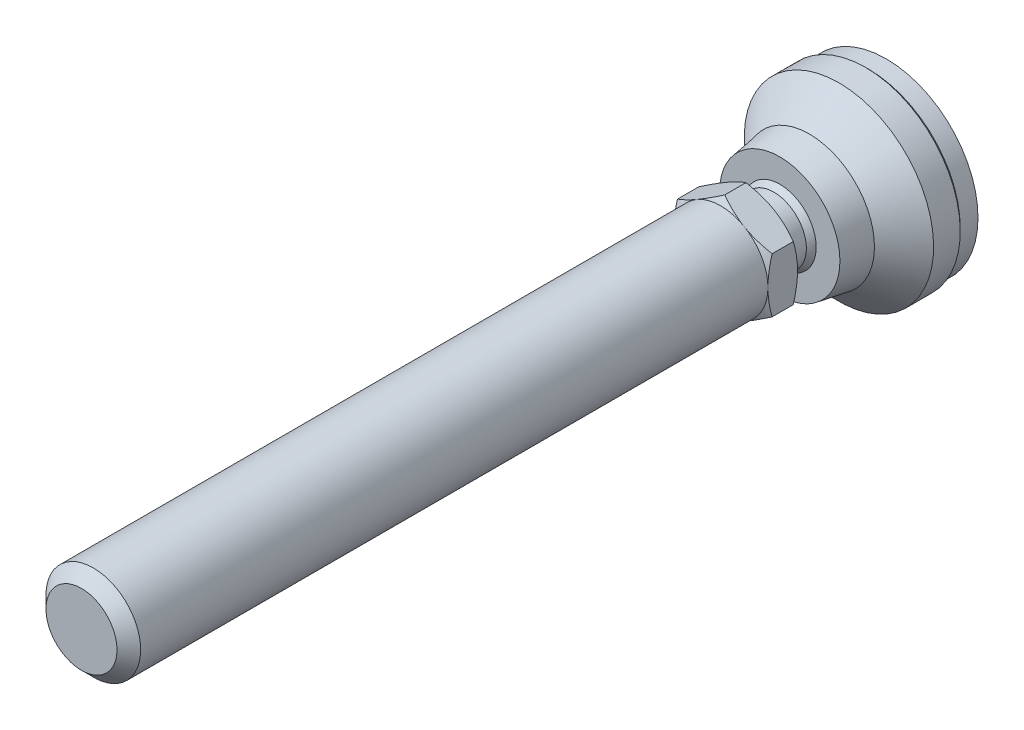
ISO-10303-21;
HEADER;
FILE_DESCRIPTION(('STEP AP214'),'2;1');
FILE_NAME('part.step','',(''),(''),'','','');
FILE_SCHEMA(('AUTOMOTIVE_DESIGN { 1 0 10303 214 1 1 1 1 }'));
ENDSEC;
DATA;
#1=APPLICATION_CONTEXT('core data for automotive mechanical design processes');
#2=APPLICATION_PROTOCOL_DEFINITION('international standard','automotive_design',2000,#1);
#3=PRODUCT_CONTEXT('',#1,'mechanical');
#4=PRODUCT('Part','Part','',(#3));
#5=PRODUCT_RELATED_PRODUCT_CATEGORY('part','',(#4));
#6=PRODUCT_DEFINITION_FORMATION('','',#4);
#7=PRODUCT_DEFINITION_CONTEXT('part definition',#1,'design');
#8=PRODUCT_DEFINITION('design','',#6,#7);
#9=PRODUCT_DEFINITION_SHAPE('','',#8);
#10=(LENGTH_UNIT() NAMED_UNIT(*) SI_UNIT(.MILLI.,.METRE.));
#11=(NAMED_UNIT(*) PLANE_ANGLE_UNIT() SI_UNIT($,.RADIAN.));
#12=(NAMED_UNIT(*) SI_UNIT($,.STERADIAN.) SOLID_ANGLE_UNIT());
#13=UNCERTAINTY_MEASURE_WITH_UNIT(LENGTH_MEASURE(1.E-05),#10,'distance_accuracy_value','');
#14=(GEOMETRIC_REPRESENTATION_CONTEXT(3) GLOBAL_UNCERTAINTY_ASSIGNED_CONTEXT((#13)) GLOBAL_UNIT_ASSIGNED_CONTEXT((#10,
#11,#12)) REPRESENTATION_CONTEXT('',''));
#15=CARTESIAN_POINT('',(0.,0.,0.));
#16=DIRECTION('',(0.,0.,1.));
#17=DIRECTION('',(1.,0.,0.));
#18=AXIS2_PLACEMENT_3D('',#15,#16,#17);
#19=CARTESIAN_POINT('',(-7.7647058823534,0.,23.));
#20=DIRECTION('',(0.,0.,1.));
#21=DIRECTION('',(0.,-1.,0.));
#22=AXIS2_PLACEMENT_3D('',#19,#20,#21);
#23=PLANE('',#22);
#24=CARTESIAN_POINT('',(0.,0.,23.));
#25=DIRECTION('',(0.,0.,-1.));
#26=DIRECTION('',(0.,1.,0.));
#27=AXIS2_PLACEMENT_3D('',#24,#25,#26);
#28=CIRCLE('',#27,5.50000000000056);
#29=CARTESIAN_POINT('',(0.,5.50000000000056,23.));
#30=VERTEX_POINT('',#29);
#31=EDGE_CURVE('E278',#30,#30,#28,.T.);
#32=ORIENTED_EDGE('',*,*,#31,.F.);
#33=EDGE_LOOP('',(#32));
#34=FACE_BOUND('',#33,.T.);
#35=CARTESIAN_POINT('',(0.,0.,23.));
#36=DIRECTION('',(0.,0.,1.));
#37=DIRECTION('',(0.,-1.,0.));
#38=AXIS2_PLACEMENT_3D('',#35,#36,#37);
#39=CIRCLE('',#38,8.);
#40=CARTESIAN_POINT('',(4.,-6.92820323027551,23.));
#41=VERTEX_POINT('',#40);
#42=CARTESIAN_POINT('',(-4.,-6.92820323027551,23.));
#43=VERTEX_POINT('',#42);
#44=EDGE_CURVE('E17',#41,#43,#39,.F.);
#45=ORIENTED_EDGE('',*,*,#44,.T.);
#46=CARTESIAN_POINT('',(-8.,0.,23.));
#47=VERTEX_POINT('',#46);
#48=EDGE_CURVE('E9',#43,#47,#39,.F.);
#49=ORIENTED_EDGE('',*,*,#48,.T.);
#50=CARTESIAN_POINT('',(-4.,6.92820323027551,23.));
#51=VERTEX_POINT('',#50);
#52=EDGE_CURVE('E22',#47,#51,#39,.F.);
#53=ORIENTED_EDGE('',*,*,#52,.T.);
#54=CARTESIAN_POINT('',(4.,6.92820323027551,23.));
#55=VERTEX_POINT('',#54);
#56=EDGE_CURVE('E417',#51,#55,#39,.F.);
#57=ORIENTED_EDGE('',*,*,#56,.T.);
#58=CARTESIAN_POINT('',(8.,0.,23.));
#59=VERTEX_POINT('',#58);
#60=EDGE_CURVE('E120',#55,#59,#39,.F.);
#61=ORIENTED_EDGE('',*,*,#60,.T.);
#62=CARTESIAN_POINT('',(0.,0.,23.));
#63=DIRECTION('',(0.,0.,1.));
#64=DIRECTION('',(0.,-1.,0.));
#65=AXIS2_PLACEMENT_3D('',#62,#63,#64);
#66=CIRCLE('',#65,8.);
#67=EDGE_CURVE('E104',#41,#59,#66,.T.);
#68=ORIENTED_EDGE('',*,*,#67,.F.);
#69=EDGE_LOOP('',(#45,#49,#53,#57,#61,#68));
#70=FACE_BOUND('',#69,.T.);
#71=ADVANCED_FACE('F14',(#34,#70),#23,.F.);
#72=CARTESIAN_POINT('',(0.,0.,3.));
#73=DIRECTION('',(0.,0.,-1.));
#74=DIRECTION('',(0.,1.,0.));
#75=AXIS2_PLACEMENT_3D('',#72,#73,#74);
#76=CYLINDRICAL_SURFACE('',#75,5.50000000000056);
#77=CARTESIAN_POINT('',(0.,0.,18.9999999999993));
#78=DIRECTION('',(0.,0.,-1.));
#79=DIRECTION('',(0.,1.,0.));
#80=AXIS2_PLACEMENT_3D('',#77,#78,#79);
#81=CIRCLE('',#80,5.50000000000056);
#82=CARTESIAN_POINT('',(0.,-5.50000000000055,18.9999999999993));
#83=VERTEX_POINT('',#82);
#84=EDGE_CURVE('E242',#83,#83,#81,.T.);
#85=ORIENTED_EDGE('',*,*,#84,.F.);
#86=EDGE_LOOP('',(#85));
#87=FACE_BOUND('',#86,.T.);
#88=ORIENTED_EDGE('',*,*,#31,.T.);
#89=EDGE_LOOP('',(#88));
#90=FACE_BOUND('',#89,.T.);
#91=ADVANCED_FACE('F346',(#87,#90),#76,.T.);
#92=CARTESIAN_POINT('',(0.,0.,14.6698729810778));
#93=DIRECTION('',(0.,0.,-1.));
#94=DIRECTION('',(0.,-1.,0.));
#95=AXIS2_PLACEMENT_3D('',#92,#93,#94);
#96=SPHERICAL_SURFACE('',#95,7.);
#97=CARTESIAN_POINT('',(0.,0.,18.));
#98=DIRECTION('',(0.,0.,-1.));
#99=DIRECTION('',(0.,1.,0.));
#100=AXIS2_PLACEMENT_3D('',#97,#98,#99);
#101=CIRCLE('',#100,6.15713034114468);
#102=CARTESIAN_POINT('',(0.,-6.15713034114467,18.));
#103=VERTEX_POINT('',#102);
#104=EDGE_CURVE('E246',#103,#103,#101,.T.);
#105=CARTESIAN_POINT('',(0.,-5.50000000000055,18.9999999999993));
#106=CARTESIAN_POINT('',(0.,-5.50771979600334,18.9901945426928));
#107=CARTESIAN_POINT('',(0.,-5.51541336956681,18.9803684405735));
#108=CARTESIAN_POINT('',(0.,-5.53074785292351,18.9606752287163));
#109=CARTESIAN_POINT('',(0.,-5.53838876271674,18.9508081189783));
#110=CARTESIAN_POINT('',(0.,-5.55361769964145,18.9310331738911));
#111=CARTESIAN_POINT('',(0.,-5.56120572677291,18.9211253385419));
#112=CARTESIAN_POINT('',(0.,-5.57632868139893,18.9012692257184));
#113=CARTESIAN_POINT('',(0.,-5.58386360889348,18.8913209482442));
#114=CARTESIAN_POINT('',(0.,-5.59888014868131,18.8713842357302));
#115=CARTESIAN_POINT('',(0.,-5.60636176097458,18.8613958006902));
#116=CARTESIAN_POINT('',(0.,-5.62127145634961,18.8413790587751));
#117=CARTESIAN_POINT('',(0.,-5.62869953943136,18.8313507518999));
#118=CARTESIAN_POINT('',(0.,-5.64350196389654,18.8112545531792));
#119=CARTESIAN_POINT('',(0.,-5.65087630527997,18.8011866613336));
#120=CARTESIAN_POINT('',(0.,-5.66557103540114,18.7810115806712));
#121=CARTESIAN_POINT('',(0.,-5.67289142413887,18.7709043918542));
#122=CARTESIAN_POINT('',(0.,-5.68747803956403,18.7506510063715));
#123=CARTESIAN_POINT('',(0.,-5.69474426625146,18.7405048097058));
#124=CARTESIAN_POINT('',(0.,-5.70922234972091,18.7201736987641));
#125=CARTESIAN_POINT('',(0.,-5.71643420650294,18.7099887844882));
#126=CARTESIAN_POINT('',(0.,-5.73080334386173,18.6895805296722));
#127=CARTESIAN_POINT('',(0.,-5.73796062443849,18.6793571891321));
#128=CARTESIAN_POINT('',(0.,-5.75222040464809,18.6588723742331));
#129=CARTESIAN_POINT('',(0.,-5.75932290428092,18.6486108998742));
#130=CARTESIAN_POINT('',(0.,-5.77347291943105,18.6280501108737));
#131=CARTESIAN_POINT('',(0.,-5.78052043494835,18.6177507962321));
#132=CARTESIAN_POINT('',(0.,-5.79456028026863,18.5971146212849));
#133=CARTESIAN_POINT('',(0.,-5.80155261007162,18.5867777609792));
#134=CARTESIAN_POINT('',(0.,-5.81548188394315,18.5660667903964));
#135=CARTESIAN_POINT('',(0.,-5.82241882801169,18.5556926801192));
#136=CARTESIAN_POINT('',(0.,-5.83623713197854,18.5349075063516));
#137=CARTESIAN_POINT('',(0.,-5.84311849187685,18.5244964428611));
#138=CARTESIAN_POINT('',(0.,-5.85682543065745,18.503637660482));
#139=CARTESIAN_POINT('',(0.,-5.86365100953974,18.4931899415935));
#140=CARTESIAN_POINT('',(0.,-5.8772461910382,18.4722581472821));
#141=CARTESIAN_POINT('',(0.,-5.88401579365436,18.4617740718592));
#142=CARTESIAN_POINT('',(0.,-5.89749882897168,18.440769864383));
#143=CARTESIAN_POINT('',(0.,-5.90421226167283,18.4302497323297));
#144=CARTESIAN_POINT('',(0.,-5.91758276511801,18.4091737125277));
#145=CARTESIAN_POINT('',(0.,-5.92423983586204,18.398617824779));
#146=CARTESIAN_POINT('',(0.,-5.93749742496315,18.3774705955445));
#147=CARTESIAN_POINT('',(0.,-5.94409794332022,18.3668792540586));
#148=CARTESIAN_POINT('',(0.,-5.9572422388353,18.3456614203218));
#149=CARTESIAN_POINT('',(0.,-5.96378601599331,18.3350349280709));
#150=CARTESIAN_POINT('',(0.,-5.97681664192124,18.3137470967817));
#151=CARTESIAN_POINT('',(0.,-5.98330349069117,18.3030857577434));
#152=CARTESIAN_POINT('',(0.,-5.99622007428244,18.2817285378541));
#153=CARTESIAN_POINT('',(0.,-6.00264980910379,18.271032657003));
#154=CARTESIAN_POINT('',(0.,-6.0154519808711,18.2496066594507));
#155=CARTESIAN_POINT('',(0.,-6.02182441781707,18.2388765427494));
#156=CARTESIAN_POINT('',(0.,-6.03451181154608,18.2173823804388));
#157=CARTESIAN_POINT('',(0.,-6.04082676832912,18.2066183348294));
#158=CARTESIAN_POINT('',(0.,-6.05339902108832,18.1850566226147));
#159=CARTESIAN_POINT('',(0.,-6.05965631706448,18.1742589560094));
#160=CARTESIAN_POINT('',(0.,-6.07211306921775,18.1526303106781));
#161=CARTESIAN_POINT('',(0.,-6.07831252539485,18.1417993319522));
#162=CARTESIAN_POINT('',(0.,-6.09065342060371,18.1201043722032));
#163=CARTESIAN_POINT('',(0.,-6.09679485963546,18.1092403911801));
#164=CARTESIAN_POINT('',(0.,-6.10901954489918,18.0874797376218));
#165=CARTESIAN_POINT('',(0.,-6.11510279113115,18.0765830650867));
#166=CARTESIAN_POINT('',(0.,-6.12721091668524,18.0547573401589));
#167=CARTESIAN_POINT('',(0.,-6.13323579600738,18.0438282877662));
#168=CARTESIAN_POINT('',(0.,-6.14522701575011,18.0219381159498));
#169=CARTESIAN_POINT('',(0.,-6.15119335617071,18.010976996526));
#170=CARTESIAN_POINT('',(0.,-6.15713034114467,18.));
#171=B_SPLINE_CURVE_WITH_KNOTS('',3,(#105,#106,#107,#108,#109,#110,#111,#112,#113,#114,#115,
#116,#117,#118,#119,#120,#121,#122,#123,#124,#125,#126,#127,#128,#129,#130,#131,#132,#133,#134,
#135,#136,#137,#138,#139,#140,#141,#142,#143,#144,#145,#146,#147,#148,#149,#150,#151,#152,#153,
#154,#155,#156,#157,#158,#159,#160,#161,#162,#163,#164,#165,#166,#167,#168,#169,#170),
.UNSPECIFIED.,.F.,.F.,(4,2,2,2,2,2,2,2,2,2,2,2,2,2,2,2,2,2,2,2,2,2,2,2,2,2,2,2,2,2,2,2,4),(0.,
0.0374389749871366,0.0748779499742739,0.112316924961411,0.149755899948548,0.187194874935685,
0.224633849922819,0.262072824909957,0.299511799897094,0.336950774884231,0.374389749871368,
0.411828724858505,0.449267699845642,0.486706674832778,0.524145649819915,0.56158462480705,
0.599023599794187,0.636462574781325,0.67390154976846,0.711340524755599,0.748779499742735,
0.786218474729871,0.823657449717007,0.861096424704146,0.898535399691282,0.93597437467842,
0.973413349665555,1.01085232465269,1.04829129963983,1.08573027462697,1.1231692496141,
1.16060822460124,1.19804719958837),.UNSPECIFIED.);
#172=EDGE_CURVE('BSEAM342',#83,#103,#171,.T.);
#173=ORIENTED_EDGE('',*,*,#84,.T.);
#174=ORIENTED_EDGE('',*,*,#104,.F.);
#175=ORIENTED_EDGE('',*,*,#172,.T.);
#176=ORIENTED_EDGE('',*,*,#172,.F.);
#177=EDGE_LOOP('',(#173,#175,#174,#176));
#178=FACE_BOUND('',#177,.T.);
#179=ADVANCED_FACE('F342',(#178),#96,.T.);
#180=CARTESIAN_POINT('',(0.,0.,3.50000000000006));
#181=DIRECTION('',(0.,0.,1.));
#182=DIRECTION('',(0.,-1.,0.));
#183=AXIS2_PLACEMENT_3D('',#180,#181,#182);
#184=CONICAL_SURFACE('',#183,16.,0.785398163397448);
#185=CARTESIAN_POINT('',(0.,0.,3.));
#186=DIRECTION('',(0.,0.,-1.));
#187=DIRECTION('',(0.,1.,0.));
#188=AXIS2_PLACEMENT_3D('',#185,#186,#187);
#189=CIRCLE('',#188,15.5);
#190=CARTESIAN_POINT('',(0.,15.5,3.));
#191=VERTEX_POINT('',#190);
#192=EDGE_CURVE('E267',#191,#191,#189,.T.);
#193=ORIENTED_EDGE('',*,*,#192,.F.);
#194=EDGE_LOOP('',(#193));
#195=FACE_BOUND('',#194,.T.);
#196=CARTESIAN_POINT('',(0.,0.,3.50000000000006));
#197=DIRECTION('',(0.,0.,-1.));
#198=DIRECTION('',(0.,1.,0.));
#199=AXIS2_PLACEMENT_3D('',#196,#197,#198);
#200=CIRCLE('',#199,16.);
#201=CARTESIAN_POINT('',(0.,16.,3.50000000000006));
#202=VERTEX_POINT('',#201);
#203=EDGE_CURVE('E270',#202,#202,#200,.T.);
#204=ORIENTED_EDGE('',*,*,#203,.T.);
#205=EDGE_LOOP('',(#204));
#206=FACE_BOUND('',#205,.T.);
#207=ADVANCED_FACE('F345',(#195,#206),#184,.T.);
#208=CARTESIAN_POINT('',(0.,0.,3.));
#209=DIRECTION('',(0.,0.,-1.));
#210=DIRECTION('',(0.,1.,0.));
#211=AXIS2_PLACEMENT_3D('',#208,#209,#210);
#212=CYLINDRICAL_SURFACE('',#211,16.);
#213=ORIENTED_EDGE('',*,*,#203,.F.);
#214=EDGE_LOOP('',(#213));
#215=FACE_BOUND('',#214,.T.);
#216=CARTESIAN_POINT('',(0.,0.,8.));
#217=DIRECTION('',(0.,0.,-1.));
#218=DIRECTION('',(0.,1.,0.));
#219=AXIS2_PLACEMENT_3D('',#216,#217,#218);
#220=CIRCLE('',#219,16.);
#221=CARTESIAN_POINT('',(0.,16.,8.));
#222=VERTEX_POINT('',#221);
#223=EDGE_CURVE('E273',#222,#222,#220,.T.);
#224=ORIENTED_EDGE('',*,*,#223,.T.);
#225=EDGE_LOOP('',(#224));
#226=FACE_BOUND('',#225,.T.);
#227=ADVANCED_FACE('F385',(#215,#226),#212,.T.);
#228=CARTESIAN_POINT('',(0.,0.,13.));
#229=DIRECTION('',(0.,0.,-1.));
#230=DIRECTION('',(0.,1.,0.));
#231=AXIS2_PLACEMENT_3D('',#228,#229,#230);
#232=CONICAL_SURFACE('',#231,11.,0.785398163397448);
#233=ORIENTED_EDGE('',*,*,#223,.F.);
#234=EDGE_LOOP('',(#233));
#235=FACE_BOUND('',#234,.T.);
#236=CARTESIAN_POINT('',(0.,0.,13.));
#237=DIRECTION('',(0.,0.,-1.));
#238=DIRECTION('',(0.,1.,0.));
#239=AXIS2_PLACEMENT_3D('',#236,#237,#238);
#240=CIRCLE('',#239,11.);
#241=CARTESIAN_POINT('',(0.,11.,13.));
#242=VERTEX_POINT('',#241);
#243=EDGE_CURVE('E276',#242,#242,#240,.T.);
#244=ORIENTED_EDGE('',*,*,#243,.T.);
#245=EDGE_LOOP('',(#244));
#246=FACE_BOUND('',#245,.T.);
#247=ADVANCED_FACE('F381',(#235,#246),#232,.T.);
#248=CARTESIAN_POINT('',(0.,0.,19.));
#249=DIRECTION('',(0.,0.,-1.));
#250=DIRECTION('',(0.,1.,0.));
#251=AXIS2_PLACEMENT_3D('',#248,#249,#250);
#252=CONICAL_SURFACE('',#251,10.,0.165148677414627);
#253=CARTESIAN_POINT('',(0.,0.,18.));
#254=DIRECTION('',(0.,0.,1.));
#255=DIRECTION('',(0.,-1.,0.));
#256=AXIS2_PLACEMENT_3D('',#253,#254,#255);
#257=CIRCLE('',#256,10.1666666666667);
#258=CARTESIAN_POINT('',(0.,-10.1666666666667,18.));
#259=VERTEX_POINT('',#258);
#260=EDGE_CURVE('E249',#259,#259,#257,.T.);
#261=ORIENTED_EDGE('',*,*,#260,.F.);
#262=EDGE_LOOP('',(#261));
#263=FACE_BOUND('',#262,.T.);
#264=ORIENTED_EDGE('',*,*,#243,.F.);
#265=EDGE_LOOP('',(#264));
#266=FACE_BOUND('',#265,.T.);
#267=ADVANCED_FACE('F340',(#263,#266),#252,.T.);
#268=CARTESIAN_POINT('',(-6.60079601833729,0.,18.));
#269=DIRECTION('',(0.,0.,-1.));
#270=DIRECTION('',(0.,1.,0.));
#271=AXIS2_PLACEMENT_3D('',#268,#269,#270);
#272=PLANE('',#271);
#273=ORIENTED_EDGE('',*,*,#260,.T.);
#274=EDGE_LOOP('',(#273));
#275=FACE_BOUND('',#274,.T.);
#276=ORIENTED_EDGE('',*,*,#104,.T.);
#277=EDGE_LOOP('',(#276));
#278=FACE_BOUND('',#277,.T.);
#279=ADVANCED_FACE('F335',(#275,#278),#272,.F.);
#280=CARTESIAN_POINT('',(0.,0.,0.));
#281=DIRECTION('',(0.,0.,1.));
#282=DIRECTION('',(0.,-1.,0.));
#283=AXIS2_PLACEMENT_3D('',#280,#281,#282);
#284=CYLINDRICAL_SURFACE('',#283,15.5);
#285=CARTESIAN_POINT('',(0.,0.,0.));
#286=DIRECTION('',(0.,0.,-1.));
#287=DIRECTION('',(0.,1.,0.));
#288=AXIS2_PLACEMENT_3D('',#285,#286,#287);
#289=CIRCLE('',#288,15.5);
#290=CARTESIAN_POINT('',(0.,15.5,0.));
#291=VERTEX_POINT('',#290);
#292=EDGE_CURVE('E230',#291,#291,#289,.T.);
#293=ORIENTED_EDGE('',*,*,#292,.F.);
#294=EDGE_LOOP('',(#293));
#295=FACE_BOUND('',#294,.T.);
#296=ORIENTED_EDGE('',*,*,#192,.T.);
#297=EDGE_LOOP('',(#296));
#298=FACE_BOUND('',#297,.T.);
#299=ADVANCED_FACE('F339',(#295,#298),#284,.T.);
#300=CARTESIAN_POINT('',(0.,0.,0.));
#301=DIRECTION('',(0.,0.,-1.));
#302=DIRECTION('',(0.,1.,0.));
#303=AXIS2_PLACEMENT_3D('',#300,#301,#302);
#304=PLANE('',#303);
#305=ORIENTED_EDGE('',*,*,#292,.T.);
#306=EDGE_LOOP('',(#305));
#307=FACE_BOUND('',#306,.T.);
#308=ADVANCED_FACE('F358',(#307),#304,.T.);
#309=CARTESIAN_POINT('',(0.,0.,23.));
#310=DIRECTION('',(0.,0.,1.));
#311=DIRECTION('',(0.,-1.,0.));
#312=AXIS2_PLACEMENT_3D('',#309,#310,#311);
#313=CONICAL_SURFACE('',#312,8.,1.0471975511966);
#314=ORIENTED_EDGE('',*,*,#44,.F.);
#315=CARTESIAN_POINT('',(-0.00019999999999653,-9.23771977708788,23.714597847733));
#316=CARTESIAN_POINT('',(0.175648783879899,-9.13619343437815,23.6559907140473));
#317=CARTESIAN_POINT('',(0.352153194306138,-9.03428856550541,23.6000434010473));
#318=CARTESIAN_POINT('',(0.706595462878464,-8.82965122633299,23.4942010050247));
#319=CARTESIAN_POINT('',(0.884533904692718,-8.72691841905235,23.4443085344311));
#320=CARTESIAN_POINT('',(1.42119823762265,-8.41707512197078,23.3046927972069));
#321=CARTESIAN_POINT('',(1.78204258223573,-8.20874154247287,23.2252811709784));
#322=CARTESIAN_POINT('',(2.32203917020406,-7.89697436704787,23.1321616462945));
#323=CARTESIAN_POINT('',(2.49957818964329,-7.79447216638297,23.1056345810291));
#324=CARTESIAN_POINT('',(2.85545911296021,-7.5890042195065,23.0611531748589));
#325=CARTESIAN_POINT('',(3.03380094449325,-7.48603851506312,23.0431980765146));
#326=CARTESIAN_POINT('',(3.39079168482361,-7.27992981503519,23.0163156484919));
#327=CARTESIAN_POINT('',(3.56944001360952,-7.17678715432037,23.0073780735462));
#328=CARTESIAN_POINT('',(3.9269017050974,-6.97040655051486,22.9987223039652));
#329=CARTESIAN_POINT('',(4.10571506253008,-6.8671686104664,22.9990038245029));
#330=CARTESIAN_POINT('',(4.44001336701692,-6.67416139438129,23.0081450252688));
#331=CARTESIAN_POINT('',(4.59552190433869,-6.58437849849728,23.0158896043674));
#332=CARTESIAN_POINT('',(4.90617476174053,-6.4050229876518,23.0382011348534));
#333=CARTESIAN_POINT('',(5.06131905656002,-6.31545038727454,23.0527685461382));
#334=CARTESIAN_POINT('',(5.52615131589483,-6.04707935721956,23.1063606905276));
#335=CARTESIAN_POINT('',(5.83501648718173,-5.86875596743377,23.1552686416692));
#336=CARTESIAN_POINT('',(6.45602322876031,-5.5102175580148,23.2775394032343));
#337=CARTESIAN_POINT('',(6.76808554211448,-5.33004829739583,23.351420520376));
#338=CARTESIAN_POINT('',(7.38755648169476,-4.97239658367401,23.519100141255));
#339=CARTESIAN_POINT('',(7.69497304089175,-4.79490955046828,23.6128592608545));
#340=CARTESIAN_POINT('',(8.0002,-4.6186866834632,23.714597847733));
#341=B_SPLINE_CURVE_WITH_KNOTS('',3,(#315,#316,#317,#318,#319,#320,#321,#322,#323,#324,#325,
#326,#327,#328,#329,#330,#331,#332,#333,#334,#335,#336,#337,#338,#339,#340),.UNSPECIFIED.,.F.,
.F.,(4,2,2,2,2,2,2,2,2,2,2,2,4),(0.,0.633973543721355,1.26821965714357,2.53934712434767,
3.1593434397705,3.77928496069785,4.39852133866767,5.01773858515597,5.55680239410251,
6.09590254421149,7.17487077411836,8.27776850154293,9.37850115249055),.UNSPECIFIED.);
#342=CARTESIAN_POINT('',(0.,-9.23760430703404,23.7145311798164));
#343=VERTEX_POINT('',#342);
#344=EDGE_CURVE('E112',#343,#41,#341,.T.);
#345=ORIENTED_EDGE('',*,*,#344,.F.);
#346=CARTESIAN_POINT('',(-8.0002,-4.6186866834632,23.714597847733));
#347=CARTESIAN_POINT('',(-7.82435121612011,-4.72021302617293,23.6559907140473));
#348=CARTESIAN_POINT('',(-7.64784680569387,-4.82211789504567,23.6000434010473));
#349=CARTESIAN_POINT('',(-7.29340453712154,-5.02675523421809,23.4942010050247));
#350=CARTESIAN_POINT('',(-7.11546609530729,-5.12948804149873,23.4443085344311));
#351=CARTESIAN_POINT('',(-6.57880176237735,-5.4393313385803,23.3046927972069));
#352=CARTESIAN_POINT('',(-6.21795741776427,-5.64766491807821,23.2252811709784));
#353=CARTESIAN_POINT('',(-5.67796082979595,-5.9594320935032,23.1321616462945));
#354=CARTESIAN_POINT('',(-5.50042181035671,-6.06193429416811,23.1056345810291));
#355=CARTESIAN_POINT('',(-5.1445408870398,-6.26740224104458,23.0611531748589));
#356=CARTESIAN_POINT('',(-4.96619905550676,-6.37036794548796,23.0431980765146));
#357=CARTESIAN_POINT('',(-4.6092083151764,-6.57647664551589,23.0163156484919));
#358=CARTESIAN_POINT('',(-4.43055998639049,-6.67961930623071,23.0073780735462));
#359=CARTESIAN_POINT('',(-4.07309829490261,-6.88599991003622,22.9987223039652));
#360=CARTESIAN_POINT('',(-3.89428493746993,-6.98923785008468,22.9990038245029));
#361=CARTESIAN_POINT('',(-3.55998663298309,-7.18224506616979,23.0081450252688));
#362=CARTESIAN_POINT('',(-3.40447809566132,-7.2720279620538,23.0158896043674));
#363=CARTESIAN_POINT('',(-3.09382523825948,-7.45138347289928,23.0382011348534));
#364=CARTESIAN_POINT('',(-2.93868094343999,-7.54095607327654,23.0527685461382));
#365=CARTESIAN_POINT('',(-2.47384868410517,-7.80932710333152,23.1063606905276));
#366=CARTESIAN_POINT('',(-2.16498351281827,-7.98765049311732,23.1552686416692));
#367=CARTESIAN_POINT('',(-1.54397677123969,-8.34618890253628,23.2775394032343));
#368=CARTESIAN_POINT('',(-1.23191445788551,-8.52635816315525,23.351420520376));
#369=CARTESIAN_POINT('',(-0.612443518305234,-8.88400987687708,23.519100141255));
#370=CARTESIAN_POINT('',(-0.305026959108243,-9.06149691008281,23.6128592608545));
#371=CARTESIAN_POINT('',(0.000200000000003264,-9.23771977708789,23.714597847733));
#372=B_SPLINE_CURVE_WITH_KNOTS('',3,(#346,#347,#348,#349,#350,#351,#352,#353,#354,#355,#356,
#357,#358,#359,#360,#361,#362,#363,#364,#365,#366,#367,#368,#369,#370,#371),.UNSPECIFIED.,.F.,
.F.,(4,2,2,2,2,2,2,2,2,2,2,2,4),(0.,0.633973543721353,1.26821965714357,2.53934712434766,
3.1593434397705,3.77928496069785,4.39852133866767,5.01773858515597,5.5568023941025,
6.09590254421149,7.17487077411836,8.27776850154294,9.37850115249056),.UNSPECIFIED.);
#373=EDGE_CURVE('E118',#43,#343,#372,.T.);
#374=ORIENTED_EDGE('',*,*,#373,.F.);
#375=EDGE_LOOP('',(#314,#345,#374));
#376=FACE_BOUND('',#375,.T.);
#377=ADVANCED_FACE('F116',(#376),#313,.T.);
#378=ORIENTED_EDGE('',*,*,#67,.T.);
#379=CARTESIAN_POINT('',(8.,12.3291645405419,26.8666422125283));
#380=CARTESIAN_POINT('',(8.,11.9803984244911,26.6977725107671));
#381=CARTESIAN_POINT('',(7.99999999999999,11.6308233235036,26.5305445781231));
#382=CARTESIAN_POINT('',(7.99999999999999,10.9296246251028,26.2002972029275));
#383=CARTESIAN_POINT('',(7.99999999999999,10.5780007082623,26.0372784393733));
#384=CARTESIAN_POINT('',(7.99999999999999,9.87042464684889,25.7155375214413));
#385=CARTESIAN_POINT('',(7.99999999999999,9.51445930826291,25.556844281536));
#386=CARTESIAN_POINT('',(7.99999999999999,8.79967022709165,25.2460563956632));
#387=CARTESIAN_POINT('',(7.99999999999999,8.44084662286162,25.0939614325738));
#388=CARTESIAN_POINT('',(7.99999999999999,7.70848255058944,24.7934836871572));
#389=CARTESIAN_POINT('',(7.99999999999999,7.33483279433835,24.6453657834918));
#390=CARTESIAN_POINT('',(7.99999999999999,6.58313417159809,24.360528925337));
#391=CARTESIAN_POINT('',(8.,6.20508481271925,24.2238112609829));
#392=CARTESIAN_POINT('',(8.,5.44471403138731,23.9654214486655));
#393=CARTESIAN_POINT('',(7.99999999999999,5.06240330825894,23.8437181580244));
#394=CARTESIAN_POINT('',(8.,4.29231265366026,23.6193116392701));
#395=CARTESIAN_POINT('',(8.,3.9045345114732,23.5166023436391));
#396=CARTESIAN_POINT('',(8.,3.12536563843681,23.3357138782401));
#397=CARTESIAN_POINT('',(8.,2.73400601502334,23.2574043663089));
#398=CARTESIAN_POINT('',(8.,2.14346554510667,23.161667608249));
#399=CARTESIAN_POINT('',(8.,1.94602008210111,23.133375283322));
#400=CARTESIAN_POINT('',(8.,1.55017434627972,23.0845897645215));
#401=CARTESIAN_POINT('',(8.,1.35177416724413,23.0640958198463));
#402=CARTESIAN_POINT('',(8.,0.95684198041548,23.0315683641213));
#403=CARTESIAN_POINT('',(8.,0.760318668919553,23.0194296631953));
#404=CARTESIAN_POINT('',(8.,0.366935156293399,23.0034681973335));
#405=CARTESIAN_POINT('',(8.,0.170074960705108,22.9996452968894));
#406=CARTESIAN_POINT('',(8.,-0.223631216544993,23.0004064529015));
#407=CARTESIAN_POINT('',(8.,-0.420477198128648,23.0049905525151));
#408=CARTESIAN_POINT('',(8.,-0.813803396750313,23.0224550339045));
#409=CARTESIAN_POINT('',(8.,-1.01028359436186,23.0353358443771));
#410=CARTESIAN_POINT('',(8.,-1.48487195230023,23.0761992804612));
#411=CARTESIAN_POINT('',(8.,-1.76263690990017,23.108250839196));
#412=CARTESIAN_POINT('',(8.,-2.31604078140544,23.1871683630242));
#413=CARTESIAN_POINT('',(8.,-2.59167939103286,23.2340364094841));
#414=CARTESIAN_POINT('',(8.,-3.41512760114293,23.3943744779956));
#415=CARTESIAN_POINT('',(8.,-3.95914795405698,23.5275471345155));
#416=CARTESIAN_POINT('',(8.,-4.77248031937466,23.7576607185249));
#417=CARTESIAN_POINT('',(8.,-5.04603178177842,23.8404723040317));
#418=CARTESIAN_POINT('',(8.,-5.59047659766,24.0144931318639));
#419=CARTESIAN_POINT('',(8.,-5.86136993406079,24.105702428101));
#420=CARTESIAN_POINT('',(8.,-6.4005874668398,24.295072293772));
#421=CARTESIAN_POINT('',(8.,-6.66891252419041,24.3932304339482));
#422=CARTESIAN_POINT('',(8.,-7.20335353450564,24.5953634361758));
#423=CARTESIAN_POINT('',(8.,-7.46946950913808,24.6993382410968));
#424=CARTESIAN_POINT('',(8.,-8.07951531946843,24.9441496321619));
#425=CARTESIAN_POINT('',(8.,-8.42276986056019,25.0866654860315));
#426=CARTESIAN_POINT('',(8.,-9.10650142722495,25.3782281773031));
#427=CARTESIAN_POINT('',(8.,-9.44697830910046,25.5272753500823));
#428=CARTESIAN_POINT('',(8.,-10.1256485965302,25.8306416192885));
#429=CARTESIAN_POINT('',(8.,-10.463841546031,25.9849617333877));
#430=CARTESIAN_POINT('',(8.,-11.1382443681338,26.2978518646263));
#431=CARTESIAN_POINT('',(8.,-11.4744542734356,26.4564218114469));
#432=CARTESIAN_POINT('',(8.,-12.1455144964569,26.7771904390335));
#433=CARTESIAN_POINT('',(8.,-12.4803632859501,26.9393923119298));
#434=CARTESIAN_POINT('',(8.,-13.1486468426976,27.2666857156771));
#435=CARTESIAN_POINT('',(8.,-13.4820815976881,27.4317772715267));
#436=CARTESIAN_POINT('',(8.,-14.4806060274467,27.9306501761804));
#437=CARTESIAN_POINT('',(8.,-15.1439021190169,28.2680231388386));
#438=CARTESIAN_POINT('',(8.,-16.1099078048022,28.7656493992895));
#439=CARTESIAN_POINT('',(8.00000000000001,-16.4140091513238,28.9232178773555));
#440=CARTESIAN_POINT('',(8.00000000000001,-17.0215481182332,29.2396177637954));
#441=CARTESIAN_POINT('',(8.00000000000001,-17.3249857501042,29.3984491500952));
#442=CARTESIAN_POINT('',(8.00000000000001,-18.2344581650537,29.8765968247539));
#443=CARTESIAN_POINT('',(8.00000000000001,-18.8396297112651,30.1975548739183));
#444=CARTESIAN_POINT('',(8.00000000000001,-20.0467986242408,30.8420888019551));
#445=CARTESIAN_POINT('',(8.00000000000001,-20.6488000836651,31.1656570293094));
#446=CARTESIAN_POINT('',(8.00000000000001,-21.8513328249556,31.8154425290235));
#447=CARTESIAN_POINT('',(8.00000000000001,-22.4518641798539,32.141659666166));
#448=CARTESIAN_POINT('',(8.,-23.0518489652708,32.4688726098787));
#449=B_SPLINE_CURVE_WITH_KNOTS('',3,(#379,#380,#381,#382,#383,#384,#385,#386,#387,#388,#389,
#390,#391,#392,#393,#394,#395,#396,#397,#398,#399,#400,#401,#402,#403,#404,#405,#406,#407,#408,
#409,#410,#411,#412,#413,#414,#415,#416,#417,#418,#419,#420,#421,#422,#423,#424,#425,#426,#427,
#428,#429,#430,#431,#432,#433,#434,#435,#436,#437,#438,#439,#440,#441,#442,#443,#444,#445,#446,
#447,#448),.UNSPECIFIED.,.F.,.F.,(4,2,2,2,2,2,2,2,2,2,2,2,2,2,2,2,2,2,2,2,2,2,2,2,2,2,2,2,2,2,2,
2,2,2,4),(0.,1.162508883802,2.32520413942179,3.49436128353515,4.66346217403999,5.86912777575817,
7.07492963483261,8.2781868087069,9.48105894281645,10.6773906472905,11.2756474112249,
11.8738465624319,12.4643696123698,13.0548830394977,13.6453994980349,14.2359464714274,
15.074295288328,15.9127619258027,17.5906603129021,18.4480257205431,19.3053966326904,
20.1624692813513,21.0195335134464,22.1344376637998,23.2493991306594,24.3645770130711,
25.4797364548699,26.5959178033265,27.7121088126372,29.9445366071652,30.9720321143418,
31.9995097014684,34.0545417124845,36.1048810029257,38.1551162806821),.UNSPECIFIED.);
#450=CARTESIAN_POINT('',(8.,-4.61880215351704,23.7145311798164));
#451=VERTEX_POINT('',#450);
#452=EDGE_CURVE('E107',#451,#59,#449,.F.);
#453=ORIENTED_EDGE('',*,*,#452,.F.);
#454=EDGE_CURVE('E100',#41,#451,#341,.T.);
#455=ORIENTED_EDGE('',*,*,#454,.F.);
#456=EDGE_LOOP('',(#378,#453,#455));
#457=FACE_BOUND('',#456,.T.);
#458=ADVANCED_FACE('F102',(#457),#313,.T.);
#459=ORIENTED_EDGE('',*,*,#60,.F.);
#460=CARTESIAN_POINT('',(8.0002,4.61868668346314,23.7145978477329));
#461=CARTESIAN_POINT('',(7.8243512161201,4.72021302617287,23.6559907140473));
#462=CARTESIAN_POINT('',(7.64784680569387,4.82211789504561,23.6000434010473));
#463=CARTESIAN_POINT('',(7.29340453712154,5.02675523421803,23.4942010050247));
#464=CARTESIAN_POINT('',(7.11546609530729,5.12948804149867,23.4443085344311));
#465=CARTESIAN_POINT('',(6.57880176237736,5.43933133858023,23.3046927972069));
#466=CARTESIAN_POINT('',(6.21795741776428,5.64766491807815,23.2252811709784));
#467=CARTESIAN_POINT('',(5.67796082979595,5.95943209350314,23.1321616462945));
#468=CARTESIAN_POINT('',(5.50042181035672,6.06193429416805,23.1056345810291));
#469=CARTESIAN_POINT('',(5.14454088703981,6.26740224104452,23.0611531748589));
#470=CARTESIAN_POINT('',(4.96619905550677,6.37036794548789,23.0431980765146));
#471=CARTESIAN_POINT('',(4.60920831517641,6.57647664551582,23.0163156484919));
#472=CARTESIAN_POINT('',(4.4305599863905,6.67961930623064,23.0073780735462));
#473=CARTESIAN_POINT('',(4.07309829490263,6.88599991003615,22.9987223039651));
#474=CARTESIAN_POINT('',(3.89428493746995,6.98923785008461,22.9990038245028));
#475=CARTESIAN_POINT('',(3.55998663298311,7.18224506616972,23.0081450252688));
#476=CARTESIAN_POINT('',(3.40447809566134,7.27202796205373,23.0158896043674));
#477=CARTESIAN_POINT('',(3.0938252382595,7.45138347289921,23.0382011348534));
#478=CARTESIAN_POINT('',(2.93868094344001,7.54095607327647,23.0527685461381));
#479=CARTESIAN_POINT('',(2.47384868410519,7.80932710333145,23.1063606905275));
#480=CARTESIAN_POINT('',(2.16498351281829,7.98765049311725,23.1552686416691));
#481=CARTESIAN_POINT('',(1.54397677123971,8.34618890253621,23.2775394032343));
#482=CARTESIAN_POINT('',(1.23191445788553,8.52635816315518,23.351420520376));
#483=CARTESIAN_POINT('',(0.612443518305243,8.88400987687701,23.519100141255));
#484=CARTESIAN_POINT('',(0.30502695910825,9.06149691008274,23.6128592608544));
#485=CARTESIAN_POINT('',(-0.000200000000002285,9.23771977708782,23.7145978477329));
#486=B_SPLINE_CURVE_WITH_KNOTS('',3,(#460,#461,#462,#463,#464,#465,#466,#467,#468,#469,#470,
#471,#472,#473,#474,#475,#476,#477,#478,#479,#480,#481,#482,#483,#484,#485),.UNSPECIFIED.,.F.,
.F.,(4,2,2,2,2,2,2,2,2,2,2,2,4),(0.,0.633973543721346,1.26821965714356,2.53934712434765,
3.15934343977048,3.77928496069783,4.39852133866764,5.01773858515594,5.55680239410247,
6.09590254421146,7.17487077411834,8.27776850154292,9.37850115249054),.UNSPECIFIED.);
#487=CARTESIAN_POINT('',(8.,4.61880215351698,23.7145311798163));
#488=VERTEX_POINT('',#487);
#489=EDGE_CURVE('E187',#488,#55,#486,.T.);
#490=ORIENTED_EDGE('',*,*,#489,.F.);
#491=EDGE_CURVE('E139',#59,#488,#449,.F.);
#492=ORIENTED_EDGE('',*,*,#491,.F.);
#493=EDGE_LOOP('',(#459,#490,#492));
#494=FACE_BOUND('',#493,.T.);
#495=ADVANCED_FACE('F416',(#494),#313,.T.);
#496=ORIENTED_EDGE('',*,*,#56,.F.);
#497=CARTESIAN_POINT('',(0.000199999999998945,9.23771977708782,23.7145978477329));
#498=CARTESIAN_POINT('',(-0.175648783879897,9.13619343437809,23.6559907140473));
#499=CARTESIAN_POINT('',(-0.352153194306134,9.03428856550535,23.6000434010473));
#500=CARTESIAN_POINT('',(-0.706595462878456,8.82965122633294,23.4942010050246));
#501=CARTESIAN_POINT('',(-0.884533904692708,8.72691841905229,23.444308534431));
#502=CARTESIAN_POINT('',(-1.42119823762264,8.41707512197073,23.3046927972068));
#503=CARTESIAN_POINT('',(-1.78204258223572,8.20874154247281,23.2252811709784));
#504=CARTESIAN_POINT('',(-2.32203917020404,7.89697436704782,23.1321616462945));
#505=CARTESIAN_POINT('',(-2.49957818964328,7.79447216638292,23.1056345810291));
#506=CARTESIAN_POINT('',(-2.85545911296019,7.58900421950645,23.0611531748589));
#507=CARTESIAN_POINT('',(-3.03380094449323,7.48603851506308,23.0431980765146));
#508=CARTESIAN_POINT('',(-3.39079168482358,7.27992981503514,23.0163156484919));
#509=CARTESIAN_POINT('',(-3.56944001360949,7.17678715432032,23.0073780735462));
#510=CARTESIAN_POINT('',(-3.92690170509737,6.97040655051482,22.9987223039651));
#511=CARTESIAN_POINT('',(-4.10571506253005,6.86716861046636,22.9990038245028));
#512=CARTESIAN_POINT('',(-4.44001336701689,6.67416139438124,23.0081450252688));
#513=CARTESIAN_POINT('',(-4.59552190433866,6.58437849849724,23.0158896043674));
#514=CARTESIAN_POINT('',(-4.9061747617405,6.40502298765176,23.0382011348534));
#515=CARTESIAN_POINT('',(-5.06131905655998,6.31545038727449,23.0527685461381));
#516=CARTESIAN_POINT('',(-5.52615131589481,6.04707935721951,23.1063606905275));
#517=CARTESIAN_POINT('',(-5.83501648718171,5.86875596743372,23.1552686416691));
#518=CARTESIAN_POINT('',(-6.45602322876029,5.51021755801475,23.2775394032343));
#519=CARTESIAN_POINT('',(-6.76808554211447,5.33004829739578,23.351420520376));
#520=CARTESIAN_POINT('',(-7.38755648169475,4.97239658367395,23.519100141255));
#521=CARTESIAN_POINT('',(-7.69497304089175,4.79490955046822,23.6128592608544));
#522=CARTESIAN_POINT('',(-8.0002,4.61868668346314,23.7145978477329));
#523=B_SPLINE_CURVE_WITH_KNOTS('',3,(#497,#498,#499,#500,#501,#502,#503,#504,#505,#506,#507,
#508,#509,#510,#511,#512,#513,#514,#515,#516,#517,#518,#519,#520,#521,#522),.UNSPECIFIED.,.F.,
.F.,(4,2,2,2,2,2,2,2,2,2,2,2,4),(0.,0.633973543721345,1.26821965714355,2.53934712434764,
3.15934343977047,3.77928496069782,4.39852133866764,5.01773858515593,5.55680239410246,
6.09590254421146,7.17487077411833,8.27776850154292,9.37850115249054),.UNSPECIFIED.);
#524=CARTESIAN_POINT('',(0.,9.23760430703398,23.7145311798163));
#525=VERTEX_POINT('',#524);
#526=EDGE_CURVE('E188',#525,#51,#523,.T.);
#527=ORIENTED_EDGE('',*,*,#526,.F.);
#528=EDGE_CURVE('E180',#55,#525,#486,.T.);
#529=ORIENTED_EDGE('',*,*,#528,.F.);
#530=EDGE_LOOP('',(#496,#527,#529));
#531=FACE_BOUND('',#530,.T.);
#532=ADVANCED_FACE('F423',(#531),#313,.T.);
#533=ORIENTED_EDGE('',*,*,#52,.F.);
#534=CARTESIAN_POINT('',(-8.,12.3291645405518,26.8666422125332));
#535=CARTESIAN_POINT('',(-8.,11.9803984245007,26.6977725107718));
#536=CARTESIAN_POINT('',(-8.,11.6308233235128,26.5305445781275));
#537=CARTESIAN_POINT('',(-8.,10.9296246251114,26.2002972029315));
#538=CARTESIAN_POINT('',(-8.,10.5780007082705,26.0372784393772));
#539=CARTESIAN_POINT('',(-8.,9.87042464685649,25.7155375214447));
#540=CARTESIAN_POINT('',(-8.,9.51445930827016,25.5568442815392));
#541=CARTESIAN_POINT('',(-8.,8.79967022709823,25.246056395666));
#542=CARTESIAN_POINT('',(-8.,8.44084662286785,25.0939614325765));
#543=CARTESIAN_POINT('',(-8.,7.70848255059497,24.7934836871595));
#544=CARTESIAN_POINT('',(-8.,7.33483279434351,24.6453657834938));
#545=CARTESIAN_POINT('',(-8.,6.58313417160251,24.3605289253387));
#546=CARTESIAN_POINT('',(-8.,6.20508481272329,24.2238112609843));
#547=CARTESIAN_POINT('',(-8.,5.4447140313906,23.9654214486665));
#548=CARTESIAN_POINT('',(-8.,5.06240330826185,23.8437181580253));
#549=CARTESIAN_POINT('',(-8.,4.29231265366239,23.6193116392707));
#550=CARTESIAN_POINT('',(-8.,3.90453451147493,23.5166023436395));
#551=CARTESIAN_POINT('',(-8.,3.12536563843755,23.3357138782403));
#552=CARTESIAN_POINT('',(-8.,2.73400601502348,23.2574043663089));
#553=CARTESIAN_POINT('',(-8.,2.1434655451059,23.1616676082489));
#554=CARTESIAN_POINT('',(-8.,1.94602008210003,23.1333752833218));
#555=CARTESIAN_POINT('',(-8.,1.55017434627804,23.0845897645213));
#556=CARTESIAN_POINT('',(-8.,1.35177416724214,23.0640958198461));
#557=CARTESIAN_POINT('',(-8.,0.956841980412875,23.0315683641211));
#558=CARTESIAN_POINT('',(-8.,0.760318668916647,23.0194296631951));
#559=CARTESIAN_POINT('',(-8.,0.366935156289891,23.0034681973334));
#560=CARTESIAN_POINT('',(-8.,0.170074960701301,22.9996452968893));
#561=CARTESIAN_POINT('',(-8.,-0.223631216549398,23.0004064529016));
#562=CARTESIAN_POINT('',(-8.,-0.42047719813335,23.0049905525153));
#563=CARTESIAN_POINT('',(-8.,-0.813803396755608,23.0224550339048));
#564=CARTESIAN_POINT('',(-8.,-1.01028359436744,23.0353358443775));
#565=CARTESIAN_POINT('',(-8.,-1.48487195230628,23.0761992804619));
#566=CARTESIAN_POINT('',(-8.,-1.76263690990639,23.1082508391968));
#567=CARTESIAN_POINT('',(-8.,-2.31604078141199,23.1871683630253));
#568=CARTESIAN_POINT('',(-8.,-2.59167939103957,23.2340364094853));
#569=CARTESIAN_POINT('',(-8.,-3.41512760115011,23.3943744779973));
#570=CARTESIAN_POINT('',(-8.,-3.95914795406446,23.5275471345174));
#571=CARTESIAN_POINT('',(-8.,-4.7724803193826,23.7576607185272));
#572=CARTESIAN_POINT('',(-8.,-5.04603178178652,23.8404723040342));
#573=CARTESIAN_POINT('',(-8.,-5.59047659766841,24.0144931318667));
#574=CARTESIAN_POINT('',(-8.,-5.86136993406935,24.1057024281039));
#575=CARTESIAN_POINT('',(-8.,-6.40058746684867,24.2950722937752));
#576=CARTESIAN_POINT('',(-8.,-6.66891252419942,24.3932304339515));
#577=CARTESIAN_POINT('',(-8.,-7.20335353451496,24.5953634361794));
#578=CARTESIAN_POINT('',(-8.,-7.46946950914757,24.6993382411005));
#579=CARTESIAN_POINT('',(-8.,-8.07951531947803,24.9441496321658));
#580=CARTESIAN_POINT('',(-8.,-8.42276986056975,25.0866654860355));
#581=CARTESIAN_POINT('',(-8.,-9.10650142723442,25.3782281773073));
#582=CARTESIAN_POINT('',(-8.,-9.4469783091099,25.5272753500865));
#583=CARTESIAN_POINT('',(-8.,-10.1256485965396,25.8306416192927));
#584=CARTESIAN_POINT('',(-8.,-10.4638415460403,25.984961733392));
#585=CARTESIAN_POINT('',(-8.,-11.1382443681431,26.2978518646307));
#586=CARTESIAN_POINT('',(-8.,-11.4744542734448,26.4564218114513));
#587=CARTESIAN_POINT('',(-8.,-12.1455144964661,26.7771904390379));
#588=CARTESIAN_POINT('',(-8.,-12.4803632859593,26.9393923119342));
#589=CARTESIAN_POINT('',(-8.,-13.1486468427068,27.2666857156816));
#590=CARTESIAN_POINT('',(-8.,-13.4820815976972,27.4317772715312));
#591=CARTESIAN_POINT('',(-8.,-14.4806060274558,27.930650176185));
#592=CARTESIAN_POINT('',(-8.,-15.1439021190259,28.2680231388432));
#593=CARTESIAN_POINT('',(-8.,-16.1099078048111,28.7656493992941));
#594=CARTESIAN_POINT('',(-8.,-16.4140091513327,28.9232178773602));
#595=CARTESIAN_POINT('',(-8.,-17.0215481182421,29.2396177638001));
#596=CARTESIAN_POINT('',(-8.,-17.3249857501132,29.3984491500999));
#597=CARTESIAN_POINT('',(-8.,-18.2344581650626,29.8765968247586));
#598=CARTESIAN_POINT('',(-7.99999999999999,-18.839629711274,30.197554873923));
#599=CARTESIAN_POINT('',(-7.99999999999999,-20.0467986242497,30.8420888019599));
#600=CARTESIAN_POINT('',(-7.99999999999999,-20.648800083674,31.1656570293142));
#601=CARTESIAN_POINT('',(-7.99999999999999,-21.8513328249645,31.8154425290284));
#602=CARTESIAN_POINT('',(-8.,-22.4518641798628,32.1416596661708));
#603=CARTESIAN_POINT('',(-8.,-23.0518489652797,32.4688726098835));
#604=B_SPLINE_CURVE_WITH_KNOTS('',3,(#534,#535,#536,#537,#538,#539,#540,#541,#542,#543,#544,
#545,#546,#547,#548,#549,#550,#551,#552,#553,#554,#555,#556,#557,#558,#559,#560,#561,#562,#563,
#564,#565,#566,#567,#568,#569,#570,#571,#572,#573,#574,#575,#576,#577,#578,#579,#580,#581,#582,
#583,#584,#585,#586,#587,#588,#589,#590,#591,#592,#593,#594,#595,#596,#597,#598,#599,#600,#601,
#602,#603),.UNSPECIFIED.,.F.,.F.,(4,2,2,2,2,2,2,2,2,2,2,2,2,2,2,2,2,2,2,2,2,2,2,2,2,2,2,2,2,2,2,
2,2,2,4),(0.,1.16250888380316,2.32520413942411,3.49436128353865,4.66346217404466,
5.86912777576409,7.07492963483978,8.27818680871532,9.48105894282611,10.677390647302,
11.2756474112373,11.8738465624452,12.464369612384,13.0548830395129,13.645399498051,
14.2359464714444,15.0742952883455,15.9127619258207,17.5906603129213,18.4480257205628,
19.3053966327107,20.1624692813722,21.0195335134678,22.1344376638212,23.2493991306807,
24.3645770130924,25.4797364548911,26.5959178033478,27.7121088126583,29.9445366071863,
30.9720321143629,31.9995097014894,34.0545417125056,36.1048810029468,38.1551162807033),.UNSPECIFIED.);
#605=CARTESIAN_POINT('',(-8.,4.61880215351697,23.7145311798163));
#606=VERTEX_POINT('',#605);
#607=EDGE_CURVE('E425',#606,#47,#604,.T.);
#608=ORIENTED_EDGE('',*,*,#607,.F.);
#609=EDGE_CURVE('E173',#51,#606,#523,.T.);
#610=ORIENTED_EDGE('',*,*,#609,.F.);
#611=EDGE_LOOP('',(#533,#608,#610));
#612=FACE_BOUND('',#611,.T.);
#613=ADVANCED_FACE('F158',(#612),#313,.T.);
#614=CARTESIAN_POINT('',(-8.,-4.61880215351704,23.7145311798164));
#615=VERTEX_POINT('',#614);
#616=EDGE_CURVE('E124',#47,#615,#604,.T.);
#617=ORIENTED_EDGE('',*,*,#616,.F.);
#618=ORIENTED_EDGE('',*,*,#48,.F.);
#619=EDGE_CURVE('E31',#615,#43,#372,.T.);
#620=ORIENTED_EDGE('',*,*,#619,.F.);
#621=EDGE_LOOP('',(#617,#618,#620));
#622=FACE_BOUND('',#621,.T.);
#623=ADVANCED_FACE('F153',(#622),#313,.T.);
#624=CARTESIAN_POINT('',(0.,0.,136.));
#625=DIRECTION('',(0.,0.,-1.));
#626=DIRECTION('',(0.,1.,0.));
#627=AXIS2_PLACEMENT_3D('',#624,#625,#626);
#628=PLANE('',#627);
#629=CARTESIAN_POINT('',(0.,0.,136.));
#630=DIRECTION('',(0.,0.,-1.));
#631=DIRECTION('',(0.,1.,0.));
#632=AXIS2_PLACEMENT_3D('',#629,#630,#631);
#633=CIRCLE('',#632,6.);
#634=CARTESIAN_POINT('',(0.,6.,136.));
#635=VERTEX_POINT('',#634);
#636=EDGE_CURVE('E233',#635,#635,#633,.T.);
#637=ORIENTED_EDGE('',*,*,#636,.F.);
#638=EDGE_LOOP('',(#637));
#639=FACE_BOUND('',#638,.T.);
#640=ADVANCED_FACE('F157',(#639),#628,.F.);
#641=CARTESIAN_POINT('',(0.,0.,136.));
#642=DIRECTION('',(0.,0.,-1.));
#643=DIRECTION('',(0.,1.,0.));
#644=AXIS2_PLACEMENT_3D('',#641,#642,#643);
#645=CONICAL_SURFACE('',#644,6.,0.785398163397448);
#646=CARTESIAN_POINT('',(0.,0.,134.));
#647=DIRECTION('',(0.,0.,-1.));
#648=DIRECTION('',(0.,1.,0.));
#649=AXIS2_PLACEMENT_3D('',#646,#647,#648);
#650=CIRCLE('',#649,8.);
#651=CARTESIAN_POINT('',(0.,8.,134.));
#652=VERTEX_POINT('',#651);
#653=EDGE_CURVE('E236',#652,#652,#650,.T.);
#654=ORIENTED_EDGE('',*,*,#653,.F.);
#655=EDGE_LOOP('',(#654));
#656=FACE_BOUND('',#655,.T.);
#657=ORIENTED_EDGE('',*,*,#636,.T.);
#658=EDGE_LOOP('',(#657));
#659=FACE_BOUND('',#658,.T.);
#660=ADVANCED_FACE('F350',(#656,#659),#645,.T.);
#661=CARTESIAN_POINT('',(0.,0.,0.315228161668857));
#662=DIRECTION('',(0.,0.,-1.));
#663=DIRECTION('',(0.,1.,0.));
#664=AXIS2_PLACEMENT_3D('',#661,#662,#663);
#665=CYLINDRICAL_SURFACE('',#664,8.);
#666=CARTESIAN_POINT('',(0.,0.,28.));
#667=DIRECTION('',(0.,0.,-1.));
#668=DIRECTION('',(0.,1.,0.));
#669=AXIS2_PLACEMENT_3D('',#666,#667,#668);
#670=CIRCLE('',#669,8.);
#671=CARTESIAN_POINT('',(4.,6.92820323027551,28.));
#672=VERTEX_POINT('',#671);
#673=CARTESIAN_POINT('',(8.,0.,28.));
#674=VERTEX_POINT('',#673);
#675=EDGE_CURVE('E239',#672,#674,#670,.T.);
#676=ORIENTED_EDGE('',*,*,#675,.F.);
#677=CARTESIAN_POINT('',(-4.,6.92820323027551,28.));
#678=VERTEX_POINT('',#677);
#679=EDGE_CURVE('E243',#678,#672,#670,.T.);
#680=ORIENTED_EDGE('',*,*,#679,.F.);
#681=CARTESIAN_POINT('',(-8.,0.,28.));
#682=VERTEX_POINT('',#681);
#683=EDGE_CURVE('E283',#682,#678,#670,.T.);
#684=ORIENTED_EDGE('',*,*,#683,.F.);
#685=CARTESIAN_POINT('',(-4.,-6.92820323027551,28.));
#686=VERTEX_POINT('',#685);
#687=EDGE_CURVE('E288',#686,#682,#670,.T.);
#688=ORIENTED_EDGE('',*,*,#687,.F.);
#689=CARTESIAN_POINT('',(4.,-6.92820323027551,28.));
#690=VERTEX_POINT('',#689);
#691=EDGE_CURVE('E121',#690,#686,#670,.T.);
#692=ORIENTED_EDGE('',*,*,#691,.F.);
#693=CARTESIAN_POINT('',(0.,0.,28.));
#694=DIRECTION('',(0.,0.,1.));
#695=DIRECTION('',(0.,-1.,0.));
#696=AXIS2_PLACEMENT_3D('',#693,#694,#695);
#697=CIRCLE('',#696,8.);
#698=EDGE_CURVE('E328',#690,#674,#697,.T.);
#699=ORIENTED_EDGE('',*,*,#698,.T.);
#700=EDGE_LOOP('',(#676,#680,#684,#688,#692,#699));
#701=FACE_BOUND('',#700,.T.);
#702=ORIENTED_EDGE('',*,*,#653,.T.);
#703=EDGE_LOOP('',(#702));
#704=FACE_BOUND('',#703,.T.);
#705=ADVANCED_FACE('F304',(#701,#704),#665,.T.);
#706=CARTESIAN_POINT('',(0.,0.,26.7141513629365));
#707=DIRECTION('',(0.,0.,-1.));
#708=DIRECTION('',(0.,1.,0.));
#709=AXIS2_PLACEMENT_3D('',#706,#707,#708);
#710=CONICAL_SURFACE('',#709,10.2271551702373,1.0471975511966);
#711=ORIENTED_EDGE('',*,*,#691,.T.);
#712=CARTESIAN_POINT('',(0.000200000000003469,-9.23771977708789,27.285402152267));
#713=CARTESIAN_POINT('',(-0.175648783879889,-9.13619343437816,27.3440092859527));
#714=CARTESIAN_POINT('',(-0.352153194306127,-9.03428856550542,27.3999565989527));
#715=CARTESIAN_POINT('',(-0.706595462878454,-8.829651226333,27.5057989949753));
#716=CARTESIAN_POINT('',(-0.884533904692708,-8.72691841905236,27.5556914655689));
#717=CARTESIAN_POINT('',(-1.42119823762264,-8.41707512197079,27.6953072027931));
#718=CARTESIAN_POINT('',(-1.78204258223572,-8.20874154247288,27.7747188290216));
#719=CARTESIAN_POINT('',(-2.32203917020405,-7.89697436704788,27.8678383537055));
#720=CARTESIAN_POINT('',(-2.49957818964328,-7.79447216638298,27.8943654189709));
#721=CARTESIAN_POINT('',(-2.8554591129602,-7.5890042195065,27.9388468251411));
#722=CARTESIAN_POINT('',(-3.03380094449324,-7.48603851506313,27.9568019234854));
#723=CARTESIAN_POINT('',(-3.3907916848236,-7.2799298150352,27.9836843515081));
#724=CARTESIAN_POINT('',(-3.5694400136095,-7.17678715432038,27.9926219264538));
#725=CARTESIAN_POINT('',(-3.92690170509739,-6.97040655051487,28.0012776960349));
#726=CARTESIAN_POINT('',(-4.10571506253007,-6.86716861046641,28.0009961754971));
#727=CARTESIAN_POINT('',(-4.44001336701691,-6.6741613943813,27.9918549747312));
#728=CARTESIAN_POINT('',(-4.59552190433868,-6.58437849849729,27.9841103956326));
#729=CARTESIAN_POINT('',(-4.90617476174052,-6.40502298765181,27.9617988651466));
#730=CARTESIAN_POINT('',(-5.06131905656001,-6.31545038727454,27.9472314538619));
#731=CARTESIAN_POINT('',(-5.52615131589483,-6.04707935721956,27.8936393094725));
#732=CARTESIAN_POINT('',(-5.83501648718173,-5.86875596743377,27.8447313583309));
#733=CARTESIAN_POINT('',(-6.45602322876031,-5.51021755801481,27.7224605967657));
#734=CARTESIAN_POINT('',(-6.76808554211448,-5.33004829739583,27.648579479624));
#735=CARTESIAN_POINT('',(-7.38755648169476,-4.97239658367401,27.480899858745));
#736=CARTESIAN_POINT('',(-7.69497304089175,-4.79490955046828,27.3871407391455));
#737=CARTESIAN_POINT('',(-8.0002,-4.6186866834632,27.285402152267));
#738=B_SPLINE_CURVE_WITH_KNOTS('',3,(#712,#713,#714,#715,#716,#717,#718,#719,#720,#721,#722,
#723,#724,#725,#726,#727,#728,#729,#730,#731,#732,#733,#734,#735,#736,#737),.UNSPECIFIED.,.F.,
.F.,(4,2,2,2,2,2,2,2,2,2,2,2,4),(0.,0.633973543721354,1.26821965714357,2.53934712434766,
3.1593434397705,3.77928496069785,4.39852133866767,5.01773858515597,5.55680239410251,
6.0959025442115,7.17487077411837,8.27776850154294,9.37850115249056),.UNSPECIFIED.);
#739=CARTESIAN_POINT('',(0.,-9.23760430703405,27.2854688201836));
#740=VERTEX_POINT('',#739);
#741=EDGE_CURVE('E300',#740,#686,#738,.T.);
#742=ORIENTED_EDGE('',*,*,#741,.F.);
#743=CARTESIAN_POINT('',(8.0002,-4.6186866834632,27.285402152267));
#744=CARTESIAN_POINT('',(7.82435121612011,-4.72021302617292,27.3440092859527));
#745=CARTESIAN_POINT('',(7.64784680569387,-4.82211789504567,27.3999565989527));
#746=CARTESIAN_POINT('',(7.29340453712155,-5.02675523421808,27.5057989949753));
#747=CARTESIAN_POINT('',(7.11546609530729,-5.12948804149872,27.5556914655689));
#748=CARTESIAN_POINT('',(6.57880176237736,-5.43933133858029,27.6953072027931));
#749=CARTESIAN_POINT('',(6.21795741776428,-5.64766491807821,27.7747188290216));
#750=CARTESIAN_POINT('',(5.67796082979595,-5.9594320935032,27.8678383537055));
#751=CARTESIAN_POINT('',(5.50042181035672,-6.06193429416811,27.8943654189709));
#752=CARTESIAN_POINT('',(5.1445408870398,-6.26740224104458,27.9388468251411));
#753=CARTESIAN_POINT('',(4.96619905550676,-6.37036794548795,27.9568019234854));
#754=CARTESIAN_POINT('',(4.6092083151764,-6.57647664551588,27.9836843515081));
#755=CARTESIAN_POINT('',(4.4305599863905,-6.67961930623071,27.9926219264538));
#756=CARTESIAN_POINT('',(4.07309829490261,-6.88599991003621,28.0012776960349));
#757=CARTESIAN_POINT('',(3.89428493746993,-6.98923785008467,28.0009961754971));
#758=CARTESIAN_POINT('',(3.55998663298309,-7.18224506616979,27.9918549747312));
#759=CARTESIAN_POINT('',(3.40447809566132,-7.27202796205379,27.9841103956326));
#760=CARTESIAN_POINT('',(3.09382523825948,-7.45138347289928,27.9617988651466));
#761=CARTESIAN_POINT('',(2.93868094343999,-7.54095607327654,27.9472314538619));
#762=CARTESIAN_POINT('',(2.47384868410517,-7.80932710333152,27.8936393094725));
#763=CARTESIAN_POINT('',(2.16498351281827,-7.98765049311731,27.8447313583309));
#764=CARTESIAN_POINT('',(1.5439767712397,-8.34618890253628,27.7224605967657));
#765=CARTESIAN_POINT('',(1.23191445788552,-8.52635816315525,27.648579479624));
#766=CARTESIAN_POINT('',(0.612443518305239,-8.88400987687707,27.480899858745));
#767=CARTESIAN_POINT('',(0.305026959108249,-9.0614969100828,27.3871407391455));
#768=CARTESIAN_POINT('',(-0.000199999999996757,-9.23771977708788,27.285402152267));
#769=B_SPLINE_CURVE_WITH_KNOTS('',3,(#743,#744,#745,#746,#747,#748,#749,#750,#751,#752,#753,
#754,#755,#756,#757,#758,#759,#760,#761,#762,#763,#764,#765,#766,#767,#768),.UNSPECIFIED.,.F.,
.F.,(4,2,2,2,2,2,2,2,2,2,2,2,4),(0.,0.633973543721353,1.26821965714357,2.53934712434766,
3.1593434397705,3.77928496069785,4.39852133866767,5.01773858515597,5.5568023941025,
6.09590254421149,7.17487077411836,8.27776850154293,9.37850115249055),.UNSPECIFIED.);
#770=EDGE_CURVE('E207',#690,#740,#769,.T.);
#771=ORIENTED_EDGE('',*,*,#770,.F.);
#772=EDGE_LOOP('',(#711,#742,#771));
#773=FACE_BOUND('',#772,.T.);
#774=ADVANCED_FACE('F298',(#773),#710,.T.);
#775=ORIENTED_EDGE('',*,*,#698,.F.);
#776=CARTESIAN_POINT('',(8.,-4.61880215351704,27.2854688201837));
#777=VERTEX_POINT('',#776);
#778=EDGE_CURVE('E221',#777,#690,#769,.T.);
#779=ORIENTED_EDGE('',*,*,#778,.F.);
#780=CARTESIAN_POINT('',(8.,12.3291645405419,24.1333577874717));
#781=CARTESIAN_POINT('',(8.,11.9803984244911,24.3022274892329));
#782=CARTESIAN_POINT('',(7.99999999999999,11.6308233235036,24.4694554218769));
#783=CARTESIAN_POINT('',(7.99999999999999,10.9296246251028,24.7997027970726));
#784=CARTESIAN_POINT('',(7.99999999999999,10.5780007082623,24.9627215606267));
#785=CARTESIAN_POINT('',(7.99999999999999,9.87042464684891,25.2844624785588));
#786=CARTESIAN_POINT('',(7.99999999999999,9.51445930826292,25.443155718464));
#787=CARTESIAN_POINT('',(7.99999999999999,8.79967022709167,25.7539436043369));
#788=CARTESIAN_POINT('',(7.99999999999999,8.44084662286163,25.9060385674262));
#789=CARTESIAN_POINT('',(7.99999999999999,7.70848255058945,26.2065163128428));
#790=CARTESIAN_POINT('',(7.99999999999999,7.33483279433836,26.3546342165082));
#791=CARTESIAN_POINT('',(7.99999999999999,6.5831341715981,26.639471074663));
#792=CARTESIAN_POINT('',(8.,6.20508481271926,26.7761887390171));
#793=CARTESIAN_POINT('',(8.,5.44471403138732,27.0345785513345));
#794=CARTESIAN_POINT('',(7.99999999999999,5.06240330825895,27.1562818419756));
#795=CARTESIAN_POINT('',(8.,4.29231265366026,27.3806883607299));
#796=CARTESIAN_POINT('',(8.,3.9045345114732,27.4833976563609));
#797=CARTESIAN_POINT('',(8.,3.1253656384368,27.6642861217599));
#798=CARTESIAN_POINT('',(8.,2.73400601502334,27.7425956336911));
#799=CARTESIAN_POINT('',(8.,2.14346554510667,27.838332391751));
#800=CARTESIAN_POINT('',(8.,1.94602008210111,27.866624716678));
#801=CARTESIAN_POINT('',(8.,1.55017434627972,27.9154102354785));
#802=CARTESIAN_POINT('',(8.,1.35177416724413,27.9359041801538));
#803=CARTESIAN_POINT('',(8.,0.95684198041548,27.9684316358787));
#804=CARTESIAN_POINT('',(8.,0.760318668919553,27.9805703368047));
#805=CARTESIAN_POINT('',(8.,0.366935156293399,27.9965318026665));
#806=CARTESIAN_POINT('',(8.,0.170074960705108,28.0003547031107));
#807=CARTESIAN_POINT('',(8.,-0.223631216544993,27.9995935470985));
#808=CARTESIAN_POINT('',(8.,-0.420477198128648,27.9950094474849));
#809=CARTESIAN_POINT('',(8.,-0.813803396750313,27.9775449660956));
#810=CARTESIAN_POINT('',(8.,-1.01028359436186,27.9646641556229));
#811=CARTESIAN_POINT('',(8.,-1.48487195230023,27.9238007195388));
#812=CARTESIAN_POINT('',(8.,-1.76263690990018,27.891749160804));
#813=CARTESIAN_POINT('',(8.,-2.31604078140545,27.8128316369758));
#814=CARTESIAN_POINT('',(8.,-2.59167939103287,27.7659635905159));
#815=CARTESIAN_POINT('',(8.,-3.41512760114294,27.6056255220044));
#816=CARTESIAN_POINT('',(8.,-3.95914795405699,27.4724528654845));
#817=CARTESIAN_POINT('',(8.,-4.77248031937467,27.2423392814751));
#818=CARTESIAN_POINT('',(8.,-5.04603178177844,27.1595276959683));
#819=CARTESIAN_POINT('',(8.,-5.59047659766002,26.9855068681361));
#820=CARTESIAN_POINT('',(8.,-5.86136993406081,26.894297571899));
#821=CARTESIAN_POINT('',(8.,-6.40058746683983,26.7049277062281));
#822=CARTESIAN_POINT('',(8.,-6.66891252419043,26.6067695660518));
#823=CARTESIAN_POINT('',(8.,-7.20335353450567,26.4046365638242));
#824=CARTESIAN_POINT('',(8.,-7.46946950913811,26.3006617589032));
#825=CARTESIAN_POINT('',(8.,-8.07951531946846,26.0558503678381));
#826=CARTESIAN_POINT('',(8.,-8.42276986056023,25.9133345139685));
#827=CARTESIAN_POINT('',(8.,-9.10650142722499,25.6217718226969));
#828=CARTESIAN_POINT('',(8.,-9.4469783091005,25.4727246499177));
#829=CARTESIAN_POINT('',(8.,-10.1256485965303,25.1693583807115));
#830=CARTESIAN_POINT('',(8.,-10.463841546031,25.0150382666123));
#831=CARTESIAN_POINT('',(8.,-11.1382443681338,24.7021481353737));
#832=CARTESIAN_POINT('',(8.,-11.4744542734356,24.5435781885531));
#833=CARTESIAN_POINT('',(8.,-12.1455144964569,24.2228095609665));
#834=CARTESIAN_POINT('',(8.,-12.4803632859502,24.0606076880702));
#835=CARTESIAN_POINT('',(8.,-13.1486468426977,23.7333142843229));
#836=CARTESIAN_POINT('',(8.,-13.4820815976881,23.5682227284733));
#837=CARTESIAN_POINT('',(8.,-14.4806060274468,23.0693498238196));
#838=CARTESIAN_POINT('',(8.,-15.1439021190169,22.7319768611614));
#839=CARTESIAN_POINT('',(8.,-16.1099078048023,22.2343506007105));
#840=CARTESIAN_POINT('',(8.00000000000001,-16.4140091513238,22.0767821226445));
#841=CARTESIAN_POINT('',(8.00000000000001,-17.0215481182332,21.7603822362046));
#842=CARTESIAN_POINT('',(8.00000000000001,-17.3249857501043,21.6015508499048));
#843=CARTESIAN_POINT('',(8.00000000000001,-18.2344581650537,21.1234031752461));
#844=CARTESIAN_POINT('',(8.00000000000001,-18.8396297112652,20.8024451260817));
#845=CARTESIAN_POINT('',(8.00000000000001,-20.0467986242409,20.1579111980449));
#846=CARTESIAN_POINT('',(8.00000000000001,-20.6488000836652,19.8343429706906));
#847=CARTESIAN_POINT('',(8.00000000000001,-21.8513328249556,19.1845574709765));
#848=CARTESIAN_POINT('',(8.00000000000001,-22.4518641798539,18.858340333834));
#849=CARTESIAN_POINT('',(8.,-23.0518489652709,18.5311273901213));
#850=B_SPLINE_CURVE_WITH_KNOTS('',3,(#780,#781,#782,#783,#784,#785,#786,#787,#788,#789,#790,
#791,#792,#793,#794,#795,#796,#797,#798,#799,#800,#801,#802,#803,#804,#805,#806,#807,#808,#809,
#810,#811,#812,#813,#814,#815,#816,#817,#818,#819,#820,#821,#822,#823,#824,#825,#826,#827,#828,
#829,#830,#831,#832,#833,#834,#835,#836,#837,#838,#839,#840,#841,#842,#843,#844,#845,#846,#847,
#848,#849),.UNSPECIFIED.,.F.,.F.,(4,2,2,2,2,2,2,2,2,2,2,2,2,2,2,2,2,2,2,2,2,2,2,2,2,2,2,2,2,2,2,
2,2,2,4),(0.,1.162508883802,2.3252041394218,3.49436128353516,4.66346217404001,5.86912777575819,
7.07492963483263,8.27818680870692,9.48105894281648,10.6773906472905,11.2756474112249,
11.8738465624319,12.4643696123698,13.0548830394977,13.6453994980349,14.2359464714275,
15.074295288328,15.9127619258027,17.5906603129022,18.4480257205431,19.3053966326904,
20.1624692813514,21.0195335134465,22.1344376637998,23.2493991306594,24.3645770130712,
25.4797364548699,26.5959178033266,27.7121088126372,29.9445366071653,30.9720321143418,
31.9995097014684,34.0545417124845,36.1048810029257,38.1551162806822),.UNSPECIFIED.);
#851=EDGE_CURVE('E222',#674,#777,#850,.T.);
#852=ORIENTED_EDGE('',*,*,#851,.F.);
#853=EDGE_LOOP('',(#775,#779,#852));
#854=FACE_BOUND('',#853,.T.);
#855=ADVANCED_FACE('F427',(#854),#710,.T.);
#856=CARTESIAN_POINT('',(-0.000200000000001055,9.23771977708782,27.2854021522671));
#857=CARTESIAN_POINT('',(0.175648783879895,9.1361934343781,27.3440092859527));
#858=CARTESIAN_POINT('',(0.352153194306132,9.03428856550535,27.3999565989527));
#859=CARTESIAN_POINT('',(0.706595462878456,8.82965122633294,27.5057989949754));
#860=CARTESIAN_POINT('',(0.884533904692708,8.7269184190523,27.555691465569));
#861=CARTESIAN_POINT('',(1.42119823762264,8.41707512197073,27.6953072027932));
#862=CARTESIAN_POINT('',(1.78204258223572,8.20874154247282,27.7747188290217));
#863=CARTESIAN_POINT('',(2.32203917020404,7.89697436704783,27.8678383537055));
#864=CARTESIAN_POINT('',(2.49957818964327,7.79447216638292,27.8943654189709));
#865=CARTESIAN_POINT('',(2.85545911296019,7.58900421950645,27.9388468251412));
#866=CARTESIAN_POINT('',(3.03380094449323,7.48603851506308,27.9568019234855));
#867=CARTESIAN_POINT('',(3.39079168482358,7.27992981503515,27.9836843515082));
#868=CARTESIAN_POINT('',(3.56944001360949,7.17678715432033,27.9926219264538));
#869=CARTESIAN_POINT('',(3.92690170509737,6.97040655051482,28.0012776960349));
#870=CARTESIAN_POINT('',(4.10571506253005,6.86716861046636,28.0009961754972));
#871=CARTESIAN_POINT('',(4.44001336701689,6.67416139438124,27.9918549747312));
#872=CARTESIAN_POINT('',(4.59552190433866,6.58437849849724,27.9841103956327));
#873=CARTESIAN_POINT('',(4.9061747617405,6.40502298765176,27.9617988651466));
#874=CARTESIAN_POINT('',(5.06131905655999,6.31545038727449,27.9472314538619));
#875=CARTESIAN_POINT('',(5.52615131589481,6.04707935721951,27.8936393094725));
#876=CARTESIAN_POINT('',(5.83501648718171,5.86875596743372,27.8447313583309));
#877=CARTESIAN_POINT('',(6.45602322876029,5.51021755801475,27.7224605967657));
#878=CARTESIAN_POINT('',(6.76808554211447,5.33004829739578,27.648579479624));
#879=CARTESIAN_POINT('',(7.38755648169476,4.97239658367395,27.4808998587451));
#880=CARTESIAN_POINT('',(7.69497304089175,4.79490955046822,27.3871407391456));
#881=CARTESIAN_POINT('',(8.0002,4.61868668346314,27.2854021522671));
#882=B_SPLINE_CURVE_WITH_KNOTS('',3,(#856,#857,#858,#859,#860,#861,#862,#863,#864,#865,#866,
#867,#868,#869,#870,#871,#872,#873,#874,#875,#876,#877,#878,#879,#880,#881),.UNSPECIFIED.,.F.,
.F.,(4,2,2,2,2,2,2,2,2,2,2,2,4),(0.,0.633973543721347,1.26821965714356,2.53934712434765,
3.15934343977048,3.77928496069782,4.39852133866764,5.01773858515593,5.55680239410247,
6.09590254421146,7.17487077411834,8.27776850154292,9.37850115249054),.UNSPECIFIED.);
#883=CARTESIAN_POINT('',(8.,4.61880215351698,27.2854688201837));
#884=VERTEX_POINT('',#883);
#885=EDGE_CURVE('E209',#672,#884,#882,.T.);
#886=ORIENTED_EDGE('',*,*,#885,.F.);
#887=ORIENTED_EDGE('',*,*,#675,.T.);
#888=EDGE_CURVE('E229',#884,#674,#850,.T.);
#889=ORIENTED_EDGE('',*,*,#888,.F.);
#890=EDGE_LOOP('',(#886,#887,#889));
#891=FACE_BOUND('',#890,.T.);
#892=ADVANCED_FACE('F159',(#891),#710,.T.);
#893=CARTESIAN_POINT('',(-8.0002,4.61868668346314,27.2854021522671));
#894=CARTESIAN_POINT('',(-7.8243512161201,4.72021302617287,27.3440092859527));
#895=CARTESIAN_POINT('',(-7.64784680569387,4.82211789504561,27.3999565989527));
#896=CARTESIAN_POINT('',(-7.29340453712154,5.02675523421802,27.5057989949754));
#897=CARTESIAN_POINT('',(-7.11546609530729,5.12948804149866,27.555691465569));
#898=CARTESIAN_POINT('',(-6.57880176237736,5.43933133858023,27.6953072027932));
#899=CARTESIAN_POINT('',(-6.21795741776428,5.64766491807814,27.7747188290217));
#900=CARTESIAN_POINT('',(-5.67796082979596,5.95943209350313,27.8678383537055));
#901=CARTESIAN_POINT('',(-5.50042181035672,6.06193429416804,27.8943654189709));
#902=CARTESIAN_POINT('',(-5.14454088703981,6.26740224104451,27.9388468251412));
#903=CARTESIAN_POINT('',(-4.96619905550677,6.37036794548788,27.9568019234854));
#904=CARTESIAN_POINT('',(-4.60920831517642,6.57647664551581,27.9836843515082));
#905=CARTESIAN_POINT('',(-4.43055998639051,6.67961930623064,27.9926219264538));
#906=CARTESIAN_POINT('',(-4.07309829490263,6.88599991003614,28.0012776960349));
#907=CARTESIAN_POINT('',(-3.89428493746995,6.9892378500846,28.0009961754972));
#908=CARTESIAN_POINT('',(-3.55998663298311,7.18224506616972,27.9918549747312));
#909=CARTESIAN_POINT('',(-3.40447809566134,7.27202796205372,27.9841103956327));
#910=CARTESIAN_POINT('',(-3.0938252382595,7.4513834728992,27.9617988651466));
#911=CARTESIAN_POINT('',(-2.93868094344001,7.54095607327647,27.9472314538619));
#912=CARTESIAN_POINT('',(-2.47384868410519,7.80932710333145,27.8936393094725));
#913=CARTESIAN_POINT('',(-2.16498351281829,7.98765049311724,27.8447313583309));
#914=CARTESIAN_POINT('',(-1.54397677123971,8.34618890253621,27.7224605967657));
#915=CARTESIAN_POINT('',(-1.23191445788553,8.52635816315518,27.648579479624));
#916=CARTESIAN_POINT('',(-0.612443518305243,8.88400987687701,27.4808998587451));
#917=CARTESIAN_POINT('',(-0.305026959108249,9.06149691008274,27.3871407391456));
#918=CARTESIAN_POINT('',(0.000200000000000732,9.23771977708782,27.2854021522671));
#919=B_SPLINE_CURVE_WITH_KNOTS('',3,(#893,#894,#895,#896,#897,#898,#899,#900,#901,#902,#903,
#904,#905,#906,#907,#908,#909,#910,#911,#912,#913,#914,#915,#916,#917,#918),.UNSPECIFIED.,.F.,
.F.,(4,2,2,2,2,2,2,2,2,2,2,2,4),(0.,0.633973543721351,1.26821965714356,2.53934712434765,
3.15934343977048,3.77928496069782,4.39852133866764,5.01773858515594,5.55680239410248,
6.09590254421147,7.17487077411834,8.27776850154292,9.37850115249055),.UNSPECIFIED.);
#920=CARTESIAN_POINT('',(0.,9.23760430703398,27.2854688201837));
#921=VERTEX_POINT('',#920);
#922=EDGE_CURVE('E208',#678,#921,#919,.T.);
#923=ORIENTED_EDGE('',*,*,#922,.F.);
#924=ORIENTED_EDGE('',*,*,#679,.T.);
#925=EDGE_CURVE('E199',#921,#672,#882,.T.);
#926=ORIENTED_EDGE('',*,*,#925,.F.);
#927=EDGE_LOOP('',(#923,#924,#926));
#928=FACE_BOUND('',#927,.T.);
#929=ADVANCED_FACE('F429',(#928),#710,.T.);
#930=CARTESIAN_POINT('',(-8.,12.3291645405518,24.1333577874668));
#931=CARTESIAN_POINT('',(-8.,11.9803984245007,24.3022274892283));
#932=CARTESIAN_POINT('',(-8.,11.6308233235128,24.4694554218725));
#933=CARTESIAN_POINT('',(-8.,10.9296246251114,24.7997027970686));
#934=CARTESIAN_POINT('',(-8.,10.5780007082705,24.9627215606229));
#935=CARTESIAN_POINT('',(-8.,9.87042464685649,25.2844624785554));
#936=CARTESIAN_POINT('',(-8.,9.51445930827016,25.4431557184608));
#937=CARTESIAN_POINT('',(-8.,8.79967022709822,25.7539436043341));
#938=CARTESIAN_POINT('',(-8.,8.44084662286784,25.9060385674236));
#939=CARTESIAN_POINT('',(-8.,7.70848255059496,26.2065163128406));
#940=CARTESIAN_POINT('',(-8.,7.3348327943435,26.3546342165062));
#941=CARTESIAN_POINT('',(-8.,6.5831341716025,26.6394710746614));
#942=CARTESIAN_POINT('',(-8.,6.20508481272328,26.7761887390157));
#943=CARTESIAN_POINT('',(-8.,5.44471403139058,27.0345785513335));
#944=CARTESIAN_POINT('',(-8.,5.06240330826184,27.1562818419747));
#945=CARTESIAN_POINT('',(-8.,4.29231265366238,27.3806883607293));
#946=CARTESIAN_POINT('',(-8.,3.90453451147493,27.4833976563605));
#947=CARTESIAN_POINT('',(-8.,3.12536563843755,27.6642861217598));
#948=CARTESIAN_POINT('',(-8.,2.73400601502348,27.7425956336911));
#949=CARTESIAN_POINT('',(-8.,2.1434655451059,27.8383323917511));
#950=CARTESIAN_POINT('',(-8.,1.94602008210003,27.8666247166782));
#951=CARTESIAN_POINT('',(-8.,1.55017434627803,27.9154102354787));
#952=CARTESIAN_POINT('',(-8.,1.35177416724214,27.9359041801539));
#953=CARTESIAN_POINT('',(-8.,0.956841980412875,27.9684316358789));
#954=CARTESIAN_POINT('',(-8.,0.760318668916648,27.9805703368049));
#955=CARTESIAN_POINT('',(-8.,0.366935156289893,27.9965318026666));
#956=CARTESIAN_POINT('',(-8.,0.170074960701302,28.0003547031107));
#957=CARTESIAN_POINT('',(-8.,-0.223631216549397,27.9995935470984));
#958=CARTESIAN_POINT('',(-8.,-0.420477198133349,27.9950094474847));
#959=CARTESIAN_POINT('',(-8.,-0.813803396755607,27.9775449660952));
#960=CARTESIAN_POINT('',(-8.,-1.01028359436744,27.9646641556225));
#961=CARTESIAN_POINT('',(-8.,-1.48487195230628,27.9238007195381));
#962=CARTESIAN_POINT('',(-8.,-1.7626369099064,27.8917491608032));
#963=CARTESIAN_POINT('',(-8.,-2.316040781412,27.8128316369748));
#964=CARTESIAN_POINT('',(-8.,-2.59167939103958,27.7659635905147));
#965=CARTESIAN_POINT('',(-8.,-3.41512760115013,27.6056255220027));
#966=CARTESIAN_POINT('',(-8.,-3.95914795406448,27.4724528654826));
#967=CARTESIAN_POINT('',(-8.,-4.77248031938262,27.2423392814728));
#968=CARTESIAN_POINT('',(-8.,-5.04603178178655,27.1595276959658));
#969=CARTESIAN_POINT('',(-8.,-5.59047659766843,26.9855068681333));
#970=CARTESIAN_POINT('',(-8.,-5.86136993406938,26.8942975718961));
#971=CARTESIAN_POINT('',(-8.,-6.4005874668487,26.7049277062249));
#972=CARTESIAN_POINT('',(-8.,-6.66891252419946,26.6067695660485));
#973=CARTESIAN_POINT('',(-8.,-7.20335353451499,26.4046365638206));
#974=CARTESIAN_POINT('',(-8.,-7.4694695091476,26.3006617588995));
#975=CARTESIAN_POINT('',(-8.,-8.07951531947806,26.0558503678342));
#976=CARTESIAN_POINT('',(-8.,-8.42276986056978,25.9133345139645));
#977=CARTESIAN_POINT('',(-8.,-9.10650142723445,25.6217718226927));
#978=CARTESIAN_POINT('',(-8.,-9.44697830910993,25.4727246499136));
#979=CARTESIAN_POINT('',(-8.,-10.1256485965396,25.1693583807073));
#980=CARTESIAN_POINT('',(-8.,-10.4638415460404,25.015038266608));
#981=CARTESIAN_POINT('',(-8.,-11.1382443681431,24.7021481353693));
#982=CARTESIAN_POINT('',(-8.,-11.4744542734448,24.5435781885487));
#983=CARTESIAN_POINT('',(-8.,-12.1455144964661,24.2228095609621));
#984=CARTESIAN_POINT('',(-8.,-12.4803632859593,24.0606076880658));
#985=CARTESIAN_POINT('',(-8.,-13.1486468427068,23.7333142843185));
#986=CARTESIAN_POINT('',(-8.,-13.4820815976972,23.5682227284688));
#987=CARTESIAN_POINT('',(-8.,-14.4806060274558,23.069349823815));
#988=CARTESIAN_POINT('',(-8.,-15.1439021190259,22.7319768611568));
#989=CARTESIAN_POINT('',(-8.,-16.1099078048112,22.2343506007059));
#990=CARTESIAN_POINT('',(-8.,-16.4140091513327,22.0767821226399));
#991=CARTESIAN_POINT('',(-8.,-17.0215481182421,21.7603822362));
#992=CARTESIAN_POINT('',(-8.,-17.3249857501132,21.6015508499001));
#993=CARTESIAN_POINT('',(-8.,-18.2344581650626,21.1234031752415));
#994=CARTESIAN_POINT('',(-7.99999999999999,-18.839629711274,20.802445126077));
#995=CARTESIAN_POINT('',(-7.99999999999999,-20.0467986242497,20.1579111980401));
#996=CARTESIAN_POINT('',(-7.99999999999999,-20.648800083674,19.8343429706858));
#997=CARTESIAN_POINT('',(-7.99999999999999,-21.8513328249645,19.1845574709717));
#998=CARTESIAN_POINT('',(-8.,-22.4518641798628,18.8583403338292));
#999=CARTESIAN_POINT('',(-8.,-23.0518489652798,18.5311273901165));
#1000=B_SPLINE_CURVE_WITH_KNOTS('',3,(#930,#931,#932,#933,#934,#935,#936,#937,#938,#939,#940,
#941,#942,#943,#944,#945,#946,#947,#948,#949,#950,#951,#952,#953,#954,#955,#956,#957,#958,#959,
#960,#961,#962,#963,#964,#965,#966,#967,#968,#969,#970,#971,#972,#973,#974,#975,#976,#977,#978,
#979,#980,#981,#982,#983,#984,#985,#986,#987,#988,#989,#990,#991,#992,#993,#994,#995,#996,#997,
#998,#999),.UNSPECIFIED.,.F.,.F.,(4,2,2,2,2,2,2,2,2,2,2,2,2,2,2,2,2,2,2,2,2,2,2,2,2,2,2,2,2,2,2,
2,2,2,4),(0.,1.16250888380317,2.32520413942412,3.49436128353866,4.66346217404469,
5.86912777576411,7.0749296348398,8.27818680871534,9.48105894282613,10.677390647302,
11.2756474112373,11.8738465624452,12.4643696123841,13.0548830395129,13.645399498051,
14.2359464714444,15.0742952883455,15.9127619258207,17.5906603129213,18.4480257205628,
19.3053966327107,20.1624692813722,21.0195335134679,22.1344376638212,23.2493991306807,
24.3645770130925,25.4797364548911,26.5959178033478,27.7121088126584,29.9445366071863,
30.9720321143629,31.9995097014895,34.0545417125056,36.1048810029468,38.1551162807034),.UNSPECIFIED.);
#1001=CARTESIAN_POINT('',(-8.,4.61880215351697,27.2854688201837));
#1002=VERTEX_POINT('',#1001);
#1003=EDGE_CURVE('E317',#682,#1002,#1000,.F.);
#1004=ORIENTED_EDGE('',*,*,#1003,.F.);
#1005=ORIENTED_EDGE('',*,*,#683,.T.);
#1006=EDGE_CURVE('E312',#1002,#678,#919,.T.);
#1007=ORIENTED_EDGE('',*,*,#1006,.F.);
#1008=EDGE_LOOP('',(#1004,#1005,#1007));
#1009=FACE_BOUND('',#1008,.T.);
#1010=ADVANCED_FACE('F430',(#1009),#710,.T.);
#1011=ORIENTED_EDGE('',*,*,#687,.T.);
#1012=CARTESIAN_POINT('',(-8.,-4.61880215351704,27.2854688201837));
#1013=VERTEX_POINT('',#1012);
#1014=EDGE_CURVE('E314',#1013,#682,#1000,.F.);
#1015=ORIENTED_EDGE('',*,*,#1014,.F.);
#1016=EDGE_CURVE('E210',#686,#1013,#738,.T.);
#1017=ORIENTED_EDGE('',*,*,#1016,.F.);
#1018=EDGE_LOOP('',(#1011,#1015,#1017));
#1019=FACE_BOUND('',#1018,.T.);
#1020=ADVANCED_FACE('F333',(#1019),#710,.T.);
#1021=CARTESIAN_POINT('',(-8.,4.61880215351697,29.));
#1022=DIRECTION('',(1.,0.,0.));
#1023=DIRECTION('',(0.,1.,0.));
#1024=AXIS2_PLACEMENT_3D('',#1021,#1022,#1023);
#1025=PLANE('',#1024);
#1026=DIRECTION('',(0.,0.,-1.));
#1027=VECTOR('',#1026,1.);
#1028=CARTESIAN_POINT('',(-8.,4.61880215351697,29.));
#1029=LINE('',#1028,#1027);
#1030=EDGE_CURVE('E255',#1002,#606,#1029,.T.);
#1031=ORIENTED_EDGE('',*,*,#1030,.T.);
#1032=ORIENTED_EDGE('',*,*,#607,.T.);
#1033=ORIENTED_EDGE('',*,*,#616,.T.);
#1034=DIRECTION('',(0.,0.,-1.));
#1035=VECTOR('',#1034,1.);
#1036=CARTESIAN_POINT('',(-8.,-4.61880215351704,29.));
#1037=LINE('',#1036,#1035);
#1038=EDGE_CURVE('E252',#1013,#615,#1037,.T.);
#1039=ORIENTED_EDGE('',*,*,#1038,.F.);
#1040=ORIENTED_EDGE('',*,*,#1014,.T.);
#1041=ORIENTED_EDGE('',*,*,#1003,.T.);
#1042=EDGE_LOOP('',(#1031,#1032,#1033,#1039,#1040,#1041));
#1043=FACE_BOUND('',#1042,.T.);
#1044=ADVANCED_FACE('F329',(#1043),#1025,.F.);
#1045=CARTESIAN_POINT('',(0.,9.23760430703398,29.));
#1046=DIRECTION('',(0.5,-0.866025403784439,0.));
#1047=DIRECTION('',(0.866025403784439,0.5,0.));
#1048=AXIS2_PLACEMENT_3D('',#1045,#1046,#1047);
#1049=PLANE('',#1048);
#1050=DIRECTION('',(0.,0.,-1.));
#1051=VECTOR('',#1050,1.);
#1052=CARTESIAN_POINT('',(0.,9.23760430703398,29.));
#1053=LINE('',#1052,#1051);
#1054=EDGE_CURVE('E258',#921,#525,#1053,.T.);
#1055=ORIENTED_EDGE('',*,*,#1054,.T.);
#1056=ORIENTED_EDGE('',*,*,#526,.T.);
#1057=ORIENTED_EDGE('',*,*,#609,.T.);
#1058=ORIENTED_EDGE('',*,*,#1030,.F.);
#1059=ORIENTED_EDGE('',*,*,#1006,.T.);
#1060=ORIENTED_EDGE('',*,*,#922,.T.);
#1061=EDGE_LOOP('',(#1055,#1056,#1057,#1058,#1059,#1060));
#1062=FACE_BOUND('',#1061,.T.);
#1063=ADVANCED_FACE('F193',(#1062),#1049,.F.);
#1064=CARTESIAN_POINT('',(8.,4.61880215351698,29.));
#1065=DIRECTION('',(-0.5,-0.866025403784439,0.));
#1066=DIRECTION('',(0.866025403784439,-0.5,0.));
#1067=AXIS2_PLACEMENT_3D('',#1064,#1065,#1066);
#1068=PLANE('',#1067);
#1069=DIRECTION('',(0.,0.,-1.));
#1070=VECTOR('',#1069,1.);
#1071=CARTESIAN_POINT('',(8.,4.61880215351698,29.));
#1072=LINE('',#1071,#1070);
#1073=EDGE_CURVE('E261',#884,#488,#1072,.T.);
#1074=ORIENTED_EDGE('',*,*,#1073,.T.);
#1075=ORIENTED_EDGE('',*,*,#489,.T.);
#1076=ORIENTED_EDGE('',*,*,#528,.T.);
#1077=ORIENTED_EDGE('',*,*,#1054,.F.);
#1078=ORIENTED_EDGE('',*,*,#925,.T.);
#1079=ORIENTED_EDGE('',*,*,#885,.T.);
#1080=EDGE_LOOP('',(#1074,#1075,#1076,#1077,#1078,#1079));
#1081=FACE_BOUND('',#1080,.T.);
#1082=ADVANCED_FACE('F189',(#1081),#1068,.F.);
#1083=CARTESIAN_POINT('',(8.,-4.61880215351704,29.));
#1084=DIRECTION('',(-1.,0.,0.));
#1085=DIRECTION('',(0.,-1.,0.));
#1086=AXIS2_PLACEMENT_3D('',#1083,#1084,#1085);
#1087=PLANE('',#1086);
#1088=DIRECTION('',(0.,0.,-1.));
#1089=VECTOR('',#1088,1.);
#1090=CARTESIAN_POINT('',(8.,-4.61880215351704,29.));
#1091=LINE('',#1090,#1089);
#1092=EDGE_CURVE('E264',#777,#451,#1091,.T.);
#1093=ORIENTED_EDGE('',*,*,#1092,.T.);
#1094=ORIENTED_EDGE('',*,*,#452,.T.);
#1095=ORIENTED_EDGE('',*,*,#491,.T.);
#1096=ORIENTED_EDGE('',*,*,#1073,.F.);
#1097=ORIENTED_EDGE('',*,*,#888,.T.);
#1098=ORIENTED_EDGE('',*,*,#851,.T.);
#1099=EDGE_LOOP('',(#1093,#1094,#1095,#1096,#1097,#1098));
#1100=FACE_BOUND('',#1099,.T.);
#1101=ADVANCED_FACE('F192',(#1100),#1087,.F.);
#1102=CARTESIAN_POINT('',(0.,-9.23760430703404,29.));
#1103=DIRECTION('',(-0.5,0.866025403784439,0.));
#1104=DIRECTION('',(-0.866025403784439,-0.5,0.));
#1105=AXIS2_PLACEMENT_3D('',#1102,#1103,#1104);
#1106=PLANE('',#1105);
#1107=DIRECTION('',(0.,0.,-1.));
#1108=VECTOR('',#1107,1.);
#1109=CARTESIAN_POINT('',(0.,-9.23760430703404,29.));
#1110=LINE('',#1109,#1108);
#1111=EDGE_CURVE('E130',#740,#343,#1110,.T.);
#1112=ORIENTED_EDGE('',*,*,#1111,.T.);
#1113=ORIENTED_EDGE('',*,*,#344,.T.);
#1114=ORIENTED_EDGE('',*,*,#454,.T.);
#1115=ORIENTED_EDGE('',*,*,#1092,.F.);
#1116=ORIENTED_EDGE('',*,*,#778,.T.);
#1117=ORIENTED_EDGE('',*,*,#770,.T.);
#1118=EDGE_LOOP('',(#1112,#1113,#1114,#1115,#1116,#1117));
#1119=FACE_BOUND('',#1118,.T.);
#1120=ADVANCED_FACE('F127',(#1119),#1106,.F.);
#1121=CARTESIAN_POINT('',(-8.,-4.61880215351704,29.));
#1122=DIRECTION('',(0.5,0.866025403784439,0.));
#1123=DIRECTION('',(-0.866025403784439,0.5,0.));
#1124=AXIS2_PLACEMENT_3D('',#1121,#1122,#1123);
#1125=PLANE('',#1124);
#1126=ORIENTED_EDGE('',*,*,#1038,.T.);
#1127=ORIENTED_EDGE('',*,*,#619,.T.);
#1128=ORIENTED_EDGE('',*,*,#373,.T.);
#1129=ORIENTED_EDGE('',*,*,#1111,.F.);
#1130=ORIENTED_EDGE('',*,*,#741,.T.);
#1131=ORIENTED_EDGE('',*,*,#1016,.T.);
#1132=EDGE_LOOP('',(#1126,#1127,#1128,#1129,#1130,#1131));
#1133=FACE_BOUND('',#1132,.T.);
#1134=ADVANCED_FACE('F309',(#1133),#1125,.F.);
#1135=CLOSED_SHELL('',(#71,#91,#179,#207,#227,#247,#267,#279,#299,#308,#377,#458,#495,#532,#613,
#623,#640,#660,#705,#774,#855,#892,#929,#1010,#1020,#1044,#1063,#1082,#1101,#1120,#1134));
#1136=MANIFOLD_SOLID_BREP('B1',#1135);
#1137=ADVANCED_BREP_SHAPE_REPRESENTATION('',(#18,#1136),#14);
#1138=SHAPE_DEFINITION_REPRESENTATION(#9,#1137);
ENDSEC;
END-ISO-10303-21;
